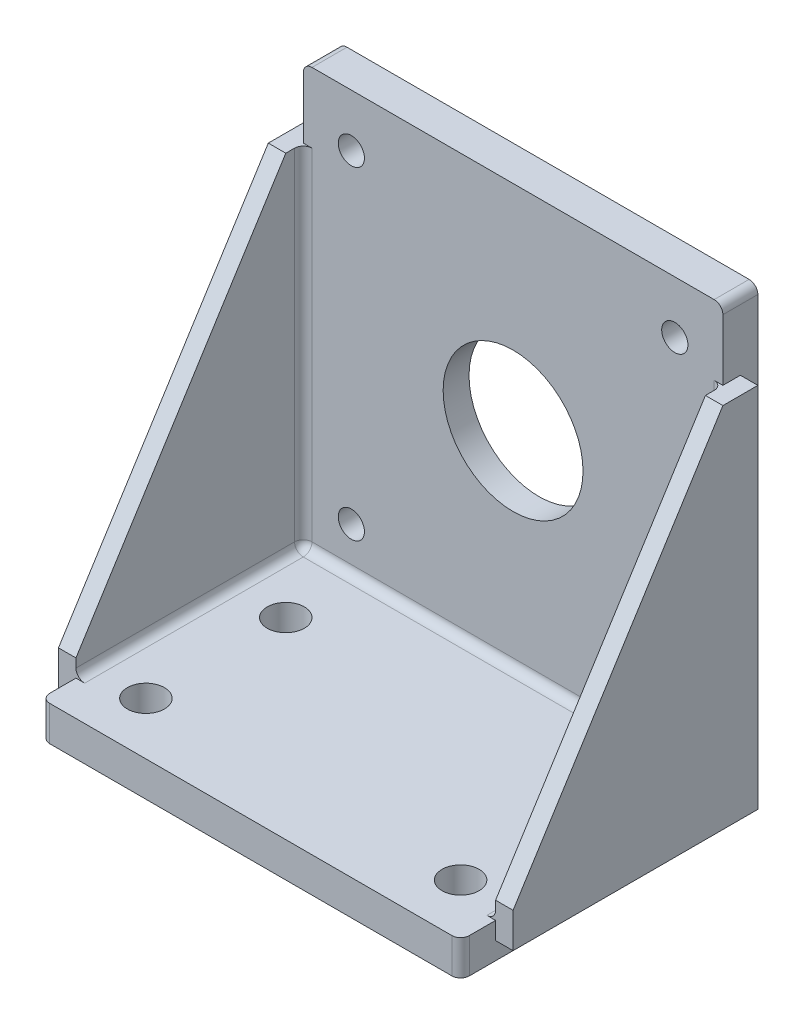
ISO-10303-21;
HEADER;
FILE_DESCRIPTION(('STEP AP214'),'2;1');
FILE_NAME('part.step','',(''),(''),'','','');
FILE_SCHEMA(('AUTOMOTIVE_DESIGN { 1 0 10303 214 1 1 1 1 }'));
ENDSEC;
DATA;
#1=APPLICATION_CONTEXT('core data for automotive mechanical design processes');
#2=APPLICATION_PROTOCOL_DEFINITION('international standard','automotive_design',2000,#1);
#3=PRODUCT_CONTEXT('',#1,'mechanical');
#4=PRODUCT('Part','Part','',(#3));
#5=PRODUCT_RELATED_PRODUCT_CATEGORY('part','',(#4));
#6=PRODUCT_DEFINITION_FORMATION('','',#4);
#7=PRODUCT_DEFINITION_CONTEXT('part definition',#1,'design');
#8=PRODUCT_DEFINITION('design','',#6,#7);
#9=PRODUCT_DEFINITION_SHAPE('','',#8);
#10=(LENGTH_UNIT() NAMED_UNIT(*) SI_UNIT(.MILLI.,.METRE.));
#11=(NAMED_UNIT(*) PLANE_ANGLE_UNIT() SI_UNIT($,.RADIAN.));
#12=(NAMED_UNIT(*) SI_UNIT($,.STERADIAN.) SOLID_ANGLE_UNIT());
#13=UNCERTAINTY_MEASURE_WITH_UNIT(LENGTH_MEASURE(1.E-05),#10,'distance_accuracy_value','');
#14=(GEOMETRIC_REPRESENTATION_CONTEXT(3) GLOBAL_UNCERTAINTY_ASSIGNED_CONTEXT((#13)) GLOBAL_UNIT_ASSIGNED_CONTEXT((#10,
#11,#12)) REPRESENTATION_CONTEXT('',''));
#15=CARTESIAN_POINT('',(0.,0.,0.));
#16=DIRECTION('',(0.,0.,1.));
#17=DIRECTION('',(1.,0.,0.));
#18=AXIS2_PLACEMENT_3D('',#15,#16,#17);
#19=CARTESIAN_POINT('',(-76.2,77.7875,12.7));
#20=DIRECTION('',(1.,0.,0.));
#21=DIRECTION('',(0.,1.,0.));
#22=AXIS2_PLACEMENT_3D('',#19,#20,#21);
#23=PLANE('',#22);
#24=DIRECTION('',(0.,0.,-1.));
#25=VECTOR('',#24,1.);
#26=CARTESIAN_POINT('',(-76.2,-87.3125,107.95));
#27=LINE('',#26,#25);
#28=CARTESIAN_POINT('',(-76.2,-87.3125,104.775));
#29=VERTEX_POINT('',#28);
#30=CARTESIAN_POINT('',(-76.2,-87.3125,6.35));
#31=VERTEX_POINT('',#30);
#32=EDGE_CURVE('E255',#29,#31,#27,.T.);
#33=ORIENTED_EDGE('',*,*,#32,.F.);
#34=DIRECTION('',(0.,1.,0.));
#35=VECTOR('',#34,1.);
#36=CARTESIAN_POINT('',(-76.2,77.7875,104.775));
#37=LINE('',#36,#35);
#38=CARTESIAN_POINT('',(-76.2,-74.6125,104.775));
#39=VERTEX_POINT('',#38);
#40=EDGE_CURVE('E325',#29,#39,#37,.T.);
#41=ORIENTED_EDGE('',*,*,#40,.T.);
#42=DIRECTION('',(0.,0.,1.));
#43=VECTOR('',#42,1.);
#44=CARTESIAN_POINT('',(-76.2,-74.6125,6.35));
#45=LINE('',#44,#43);
#46=CARTESIAN_POINT('',(-76.2,-74.6125,95.25));
#47=VERTEX_POINT('',#46);
#48=EDGE_CURVE('E258',#47,#39,#45,.T.);
#49=ORIENTED_EDGE('',*,*,#48,.F.);
#50=DIRECTION('',(0.,-1.,0.));
#51=VECTOR('',#50,1.);
#52=CARTESIAN_POINT('',(-76.2,-68.2625,95.25));
#53=LINE('',#52,#51);
#54=CARTESIAN_POINT('',(-76.2,-80.9625,95.25));
#55=VERTEX_POINT('',#54);
#56=EDGE_CURVE('E246',#47,#55,#53,.T.);
#57=ORIENTED_EDGE('',*,*,#56,.T.);
#58=DIRECTION('',(0.,0.,1.));
#59=VECTOR('',#58,1.);
#60=CARTESIAN_POINT('',(-76.2,-80.9625,6.35));
#61=LINE('',#60,#59);
#62=CARTESIAN_POINT('',(-76.2,-80.9625,6.35));
#63=VERTEX_POINT('',#62);
#64=EDGE_CURVE('E229',#63,#55,#61,.T.);
#65=ORIENTED_EDGE('',*,*,#64,.F.);
#66=DIRECTION('',(0.,-1.,0.));
#67=VECTOR('',#66,1.);
#68=CARTESIAN_POINT('',(-76.2,-74.6125,6.35));
#69=LINE('',#68,#67);
#70=EDGE_CURVE('E242',#63,#31,#69,.T.);
#71=ORIENTED_EDGE('',*,*,#70,.T.);
#72=EDGE_LOOP('',(#33,#41,#49,#57,#65,#71));
#73=FACE_BOUND('',#72,.T.);
#74=ADVANCED_FACE('F28',(#73),#23,.F.);
#75=CARTESIAN_POINT('',(76.2,-74.6125,12.7));
#76=DIRECTION('',(-1.,0.,0.));
#77=DIRECTION('',(0.,0.,1.));
#78=AXIS2_PLACEMENT_3D('',#75,#76,#77);
#79=PLANE('',#78);
#80=DIRECTION('',(0.,1.,0.));
#81=VECTOR('',#80,1.);
#82=CARTESIAN_POINT('',(76.2,-74.6125,0.));
#83=LINE('',#82,#81);
#84=CARTESIAN_POINT('',(76.2,-74.6125,0.));
#85=VERTEX_POINT('',#84);
#86=CARTESIAN_POINT('',(76.2,74.6125,0.));
#87=VERTEX_POINT('',#86);
#88=EDGE_CURVE('E501',#85,#87,#83,.T.);
#89=ORIENTED_EDGE('',*,*,#88,.T.);
#90=DIRECTION('',(0.,0.,-1.));
#91=VECTOR('',#90,1.);
#92=CARTESIAN_POINT('',(76.2,74.6125,12.7));
#93=LINE('',#92,#91);
#94=CARTESIAN_POINT('',(76.2,74.6125,12.7));
#95=VERTEX_POINT('',#94);
#96=EDGE_CURVE('E312',#87,#95,#93,.F.);
#97=ORIENTED_EDGE('',*,*,#96,.T.);
#98=DIRECTION('',(0.,1.,0.));
#99=VECTOR('',#98,1.);
#100=CARTESIAN_POINT('',(76.2,-74.6125,12.7));
#101=LINE('',#100,#99);
#102=CARTESIAN_POINT('',(76.2,52.3875,12.7));
#103=VERTEX_POINT('',#102);
#104=EDGE_CURVE('E284',#103,#95,#101,.T.);
#105=ORIENTED_EDGE('',*,*,#104,.F.);
#106=DIRECTION('',(0.,0.,1.));
#107=VECTOR('',#106,1.);
#108=CARTESIAN_POINT('',(76.2,52.3875,6.35));
#109=LINE('',#108,#107);
#110=CARTESIAN_POINT('',(76.2,52.3875,6.35));
#111=VERTEX_POINT('',#110);
#112=EDGE_CURVE('E435',#111,#103,#109,.T.);
#113=ORIENTED_EDGE('',*,*,#112,.F.);
#114=DIRECTION('',(0.,1.,0.));
#115=VECTOR('',#114,1.);
#116=CARTESIAN_POINT('',(76.2,-80.9625,6.35));
#117=LINE('',#116,#115);
#118=CARTESIAN_POINT('',(76.2,-74.6125,6.35));
#119=VERTEX_POINT('',#118);
#120=EDGE_CURVE('E450',#119,#111,#117,.T.);
#121=ORIENTED_EDGE('',*,*,#120,.F.);
#122=DIRECTION('',(0.,0.,-1.));
#123=VECTOR('',#122,1.);
#124=CARTESIAN_POINT('',(76.2,-74.6125,12.7));
#125=LINE('',#124,#123);
#126=EDGE_CURVE('E484',#119,#85,#125,.T.);
#127=ORIENTED_EDGE('',*,*,#126,.T.);
#128=EDGE_LOOP('',(#89,#97,#105,#113,#121,#127));
#129=FACE_BOUND('',#128,.T.);
#130=ADVANCED_FACE('F664',(#129),#79,.F.);
#131=CARTESIAN_POINT('',(-76.2,77.7875,12.7));
#132=DIRECTION('',(0.,0.,1.));
#133=DIRECTION('',(1.,0.,0.));
#134=AXIS2_PLACEMENT_3D('',#131,#132,#133);
#135=PLANE('',#134);
#136=CARTESIAN_POINT('',(0.,0.,12.7));
#137=DIRECTION('',(0.,0.,1.));
#138=DIRECTION('',(1.,0.,0.));
#139=AXIS2_PLACEMENT_3D('',#136,#137,#138);
#140=CIRCLE('',#139,25.4);
#141=CARTESIAN_POINT('',(25.4,0.,12.7));
#142=VERTEX_POINT('',#141);
#143=EDGE_CURVE('E617',#142,#142,#140,.T.);
#144=ORIENTED_EDGE('',*,*,#143,.F.);
#145=EDGE_LOOP('',(#144));
#146=FACE_BOUND('',#145,.T.);
#147=CARTESIAN_POINT('',(58.7375,-58.7375,12.7));
#148=DIRECTION('',(0.,0.,1.));
#149=DIRECTION('',(1.,0.,0.));
#150=AXIS2_PLACEMENT_3D('',#147,#148,#149);
#151=CIRCLE('',#150,4.76249999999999);
#152=CARTESIAN_POINT('',(63.5,-58.7375,12.7));
#153=VERTEX_POINT('',#152);
#154=EDGE_CURVE('E523',#153,#153,#151,.T.);
#155=ORIENTED_EDGE('',*,*,#154,.F.);
#156=EDGE_LOOP('',(#155));
#157=FACE_BOUND('',#156,.T.);
#158=CARTESIAN_POINT('',(58.7375,58.7375,12.7));
#159=DIRECTION('',(0.,0.,1.));
#160=DIRECTION('',(1.,0.,0.));
#161=AXIS2_PLACEMENT_3D('',#158,#159,#160);
#162=CIRCLE('',#161,4.7625);
#163=CARTESIAN_POINT('',(63.5,58.7375,12.7));
#164=VERTEX_POINT('',#163);
#165=EDGE_CURVE('E511',#164,#164,#162,.T.);
#166=ORIENTED_EDGE('',*,*,#165,.F.);
#167=EDGE_LOOP('',(#166));
#168=FACE_BOUND('',#167,.T.);
#169=DIRECTION('',(-1.,0.,0.));
#170=VECTOR('',#169,1.);
#171=CARTESIAN_POINT('',(76.2,77.7875,12.7));
#172=LINE('',#171,#170);
#173=CARTESIAN_POINT('',(73.025,77.7875,12.7));
#174=VERTEX_POINT('',#173);
#175=CARTESIAN_POINT('',(-73.0249999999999,77.7875,12.7));
#176=VERTEX_POINT('',#175);
#177=EDGE_CURVE('E285',#174,#176,#172,.T.);
#178=ORIENTED_EDGE('',*,*,#177,.T.);
#179=CARTESIAN_POINT('',(-73.025,74.6125,12.7));
#180=DIRECTION('',(0.,0.,1.));
#181=DIRECTION('',(1.,0.,0.));
#182=AXIS2_PLACEMENT_3D('',#179,#180,#181);
#183=CIRCLE('',#182,3.175);
#184=CARTESIAN_POINT('',(-76.2,74.6125,12.7));
#185=VERTEX_POINT('',#184);
#186=EDGE_CURVE('E310',#176,#185,#183,.T.);
#187=ORIENTED_EDGE('',*,*,#186,.T.);
#188=DIRECTION('',(0.,-1.,0.));
#189=VECTOR('',#188,1.);
#190=CARTESIAN_POINT('',(-76.2,77.7875,12.7));
#191=LINE('',#190,#189);
#192=CARTESIAN_POINT('',(-76.2,52.3875,12.7));
#193=VERTEX_POINT('',#192);
#194=EDGE_CURVE('E281',#185,#193,#191,.T.);
#195=ORIENTED_EDGE('',*,*,#194,.T.);
#196=DIRECTION('',(1.,0.,0.));
#197=VECTOR('',#196,1.);
#198=CARTESIAN_POINT('',(-82.55,52.3875,12.7));
#199=LINE('',#198,#197);
#200=CARTESIAN_POINT('',(-73.025,52.3875,12.7));
#201=VERTEX_POINT('',#200);
#202=EDGE_CURVE('E43',#193,#201,#199,.T.);
#203=ORIENTED_EDGE('',*,*,#202,.T.);
#204=DIRECTION('',(0.,-1.,0.));
#205=VECTOR('',#204,1.);
#206=CARTESIAN_POINT('',(-73.025,77.7875,12.7));
#207=LINE('',#206,#205);
#208=CARTESIAN_POINT('',(-73.025,-71.4375,12.7));
#209=VERTEX_POINT('',#208);
#210=EDGE_CURVE('E306',#201,#209,#207,.T.);
#211=ORIENTED_EDGE('',*,*,#210,.T.);
#212=DIRECTION('',(-1.,0.,0.));
#213=VECTOR('',#212,1.);
#214=CARTESIAN_POINT('',(76.2,-71.4375,12.7));
#215=LINE('',#214,#213);
#216=CARTESIAN_POINT('',(73.025,-71.4375,12.7));
#217=VERTEX_POINT('',#216);
#218=EDGE_CURVE('E387',#209,#217,#215,.F.);
#219=ORIENTED_EDGE('',*,*,#218,.T.);
#220=DIRECTION('',(0.,1.,0.));
#221=VECTOR('',#220,1.);
#222=CARTESIAN_POINT('',(73.025,77.7875,12.7));
#223=LINE('',#222,#221);
#224=CARTESIAN_POINT('',(73.025,52.3875,12.7));
#225=VERTEX_POINT('',#224);
#226=EDGE_CURVE('E302',#217,#225,#223,.T.);
#227=ORIENTED_EDGE('',*,*,#226,.T.);
#228=DIRECTION('',(1.,0.,0.));
#229=VECTOR('',#228,1.);
#230=CARTESIAN_POINT('',(-76.2,52.3875,12.7));
#231=LINE('',#230,#229);
#232=EDGE_CURVE('E300',#225,#103,#231,.T.);
#233=ORIENTED_EDGE('',*,*,#232,.T.);
#234=ORIENTED_EDGE('',*,*,#104,.T.);
#235=CARTESIAN_POINT('',(73.025,74.6125,12.7));
#236=DIRECTION('',(0.,0.,1.));
#237=DIRECTION('',(1.,0.,0.));
#238=AXIS2_PLACEMENT_3D('',#235,#236,#237);
#239=CIRCLE('',#238,3.175);
#240=EDGE_CURVE('E308',#95,#174,#239,.T.);
#241=ORIENTED_EDGE('',*,*,#240,.T.);
#242=EDGE_LOOP('',(#178,#187,#195,#203,#211,#219,#227,#233,#234,#241));
#243=FACE_BOUND('',#242,.T.);
#244=CARTESIAN_POINT('',(-58.7375,58.7375,12.7));
#245=DIRECTION('',(0.,0.,1.));
#246=DIRECTION('',(1.,0.,0.));
#247=AXIS2_PLACEMENT_3D('',#244,#245,#246);
#248=CIRCLE('',#247,4.7625);
#249=CARTESIAN_POINT('',(-53.975,58.7375,12.7));
#250=VERTEX_POINT('',#249);
#251=EDGE_CURVE('E517',#250,#250,#248,.T.);
#252=ORIENTED_EDGE('',*,*,#251,.F.);
#253=EDGE_LOOP('',(#252));
#254=FACE_BOUND('',#253,.T.);
#255=CARTESIAN_POINT('',(-58.7375,-58.7375,12.7));
#256=DIRECTION('',(0.,0.,1.));
#257=DIRECTION('',(1.,0.,0.));
#258=AXIS2_PLACEMENT_3D('',#255,#256,#257);
#259=CIRCLE('',#258,4.7625);
#260=CARTESIAN_POINT('',(-53.975,-58.7375,12.7));
#261=VERTEX_POINT('',#260);
#262=EDGE_CURVE('E529',#261,#261,#259,.T.);
#263=ORIENTED_EDGE('',*,*,#262,.F.);
#264=EDGE_LOOP('',(#263));
#265=FACE_BOUND('',#264,.T.);
#266=ADVANCED_FACE('F341',(#146,#157,#168,#243,#254,#265),#135,.T.);
#267=CARTESIAN_POINT('',(-76.2,77.7875,0.));
#268=DIRECTION('',(0.,0.,1.));
#269=DIRECTION('',(1.,0.,0.));
#270=AXIS2_PLACEMENT_3D('',#267,#268,#269);
#271=PLANE('',#270);
#272=CARTESIAN_POINT('',(0.,0.,0.));
#273=DIRECTION('',(0.,0.,-1.));
#274=DIRECTION('',(-1.,0.,0.));
#275=AXIS2_PLACEMENT_3D('',#272,#273,#274);
#276=CIRCLE('',#275,63.5635);
#277=CARTESIAN_POINT('',(-63.5635,0.,0.));
#278=VERTEX_POINT('',#277);
#279=EDGE_CURVE('E620',#278,#278,#276,.T.);
#280=ORIENTED_EDGE('',*,*,#279,.F.);
#281=EDGE_LOOP('',(#280));
#282=FACE_BOUND('',#281,.T.);
#283=CARTESIAN_POINT('',(58.7375,-58.7375,0.));
#284=DIRECTION('',(0.,0.,1.));
#285=DIRECTION('',(1.,0.,0.));
#286=AXIS2_PLACEMENT_3D('',#283,#284,#285);
#287=CIRCLE('',#286,4.76249999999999);
#288=CARTESIAN_POINT('',(63.5,-58.7375,0.));
#289=VERTEX_POINT('',#288);
#290=EDGE_CURVE('E526',#289,#289,#287,.T.);
#291=ORIENTED_EDGE('',*,*,#290,.T.);
#292=EDGE_LOOP('',(#291));
#293=FACE_BOUND('',#292,.T.);
#294=CARTESIAN_POINT('',(58.7375,58.7375,0.));
#295=DIRECTION('',(0.,0.,1.));
#296=DIRECTION('',(1.,0.,0.));
#297=AXIS2_PLACEMENT_3D('',#294,#295,#296);
#298=CIRCLE('',#297,4.7625);
#299=CARTESIAN_POINT('',(63.5,58.7375,0.));
#300=VERTEX_POINT('',#299);
#301=EDGE_CURVE('E514',#300,#300,#298,.T.);
#302=ORIENTED_EDGE('',*,*,#301,.T.);
#303=EDGE_LOOP('',(#302));
#304=FACE_BOUND('',#303,.T.);
#305=DIRECTION('',(0.,-1.,0.));
#306=VECTOR('',#305,1.);
#307=CARTESIAN_POINT('',(-76.2,77.7875,0.));
#308=LINE('',#307,#306);
#309=CARTESIAN_POINT('',(-76.2,74.6125,0.));
#310=VERTEX_POINT('',#309);
#311=CARTESIAN_POINT('',(-76.2,-74.6125,0.));
#312=VERTEX_POINT('',#311);
#313=EDGE_CURVE('E506',#310,#312,#308,.T.);
#314=ORIENTED_EDGE('',*,*,#313,.F.);
#315=CARTESIAN_POINT('',(-73.025,74.6125,0.));
#316=DIRECTION('',(0.,0.,1.));
#317=DIRECTION('',(1.,0.,0.));
#318=AXIS2_PLACEMENT_3D('',#315,#316,#317);
#319=CIRCLE('',#318,3.175);
#320=CARTESIAN_POINT('',(-73.0249999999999,77.7875,0.));
#321=VERTEX_POINT('',#320);
#322=EDGE_CURVE('E293',#310,#321,#319,.F.);
#323=ORIENTED_EDGE('',*,*,#322,.T.);
#324=DIRECTION('',(-1.,0.,0.));
#325=VECTOR('',#324,1.);
#326=CARTESIAN_POINT('',(76.2,77.7875,0.));
#327=LINE('',#326,#325);
#328=CARTESIAN_POINT('',(73.025,77.7875,0.));
#329=VERTEX_POINT('',#328);
#330=EDGE_CURVE('E508',#329,#321,#327,.T.);
#331=ORIENTED_EDGE('',*,*,#330,.F.);
#332=CARTESIAN_POINT('',(73.025,74.6125,0.));
#333=DIRECTION('',(0.,0.,1.));
#334=DIRECTION('',(1.,0.,0.));
#335=AXIS2_PLACEMENT_3D('',#332,#333,#334);
#336=CIRCLE('',#335,3.175);
#337=EDGE_CURVE('E291',#329,#87,#336,.F.);
#338=ORIENTED_EDGE('',*,*,#337,.T.);
#339=ORIENTED_EDGE('',*,*,#88,.F.);
#340=DIRECTION('',(-1.,0.,0.));
#341=VECTOR('',#340,1.);
#342=CARTESIAN_POINT('',(76.2,-74.6125,0.));
#343=LINE('',#342,#341);
#344=EDGE_CURVE('E503',#85,#312,#343,.T.);
#345=ORIENTED_EDGE('',*,*,#344,.T.);
#346=EDGE_LOOP('',(#314,#323,#331,#338,#339,#345));
#347=FACE_BOUND('',#346,.T.);
#348=CARTESIAN_POINT('',(-58.7375,58.7375,0.));
#349=DIRECTION('',(0.,0.,1.));
#350=DIRECTION('',(1.,0.,0.));
#351=AXIS2_PLACEMENT_3D('',#348,#349,#350);
#352=CIRCLE('',#351,4.7625);
#353=CARTESIAN_POINT('',(-53.975,58.7375,0.));
#354=VERTEX_POINT('',#353);
#355=EDGE_CURVE('E520',#354,#354,#352,.T.);
#356=ORIENTED_EDGE('',*,*,#355,.T.);
#357=EDGE_LOOP('',(#356));
#358=FACE_BOUND('',#357,.T.);
#359=CARTESIAN_POINT('',(-58.7375,-58.7375,0.));
#360=DIRECTION('',(0.,0.,1.));
#361=DIRECTION('',(1.,0.,0.));
#362=AXIS2_PLACEMENT_3D('',#359,#360,#361);
#363=CIRCLE('',#362,4.7625);
#364=CARTESIAN_POINT('',(-53.975,-58.7375,0.));
#365=VERTEX_POINT('',#364);
#366=EDGE_CURVE('E532',#365,#365,#363,.T.);
#367=ORIENTED_EDGE('',*,*,#366,.T.);
#368=EDGE_LOOP('',(#367));
#369=FACE_BOUND('',#368,.T.);
#370=ADVANCED_FACE('F660',(#282,#293,#304,#347,#358,#369),#271,.F.);
#371=CARTESIAN_POINT('',(76.2,77.7875,12.7));
#372=DIRECTION('',(0.,-1.,0.));
#373=DIRECTION('',(1.,0.,0.));
#374=AXIS2_PLACEMENT_3D('',#371,#372,#373);
#375=PLANE('',#374);
#376=ORIENTED_EDGE('',*,*,#330,.T.);
#377=DIRECTION('',(0.,0.,-1.));
#378=VECTOR('',#377,1.);
#379=CARTESIAN_POINT('',(-73.025,77.7875,12.7));
#380=LINE('',#379,#378);
#381=EDGE_CURVE('E298',#321,#176,#380,.F.);
#382=ORIENTED_EDGE('',*,*,#381,.T.);
#383=ORIENTED_EDGE('',*,*,#177,.F.);
#384=DIRECTION('',(0.,0.,-1.));
#385=VECTOR('',#384,1.);
#386=CARTESIAN_POINT('',(73.025,77.7875,12.7));
#387=LINE('',#386,#385);
#388=EDGE_CURVE('E295',#174,#329,#387,.T.);
#389=ORIENTED_EDGE('',*,*,#388,.T.);
#390=EDGE_LOOP('',(#376,#382,#383,#389));
#391=FACE_BOUND('',#390,.T.);
#392=ADVANCED_FACE('F671',(#391),#375,.F.);
#393=ORIENTED_EDGE('',*,*,#194,.F.);
#394=DIRECTION('',(0.,0.,-1.));
#395=VECTOR('',#394,1.);
#396=CARTESIAN_POINT('',(-76.2,74.6125,12.7));
#397=LINE('',#396,#395);
#398=EDGE_CURVE('E288',#185,#310,#397,.T.);
#399=ORIENTED_EDGE('',*,*,#398,.T.);
#400=ORIENTED_EDGE('',*,*,#313,.T.);
#401=DIRECTION('',(0.,0.,-1.));
#402=VECTOR('',#401,1.);
#403=CARTESIAN_POINT('',(-76.2,-74.6125,12.7));
#404=LINE('',#403,#402);
#405=CARTESIAN_POINT('',(-76.2,-74.6125,6.35));
#406=VERTEX_POINT('',#405);
#407=EDGE_CURVE('E487',#406,#312,#404,.T.);
#408=ORIENTED_EDGE('',*,*,#407,.F.);
#409=DIRECTION('',(0.,1.,0.));
#410=VECTOR('',#409,1.);
#411=CARTESIAN_POINT('',(-76.2,-80.9625,6.35));
#412=LINE('',#411,#410);
#413=CARTESIAN_POINT('',(-76.2,52.3875,6.35));
#414=VERTEX_POINT('',#413);
#415=EDGE_CURVE('E454',#406,#414,#412,.T.);
#416=ORIENTED_EDGE('',*,*,#415,.T.);
#417=DIRECTION('',(0.,0.,1.));
#418=VECTOR('',#417,1.);
#419=CARTESIAN_POINT('',(-76.2,52.3875,6.35));
#420=LINE('',#419,#418);
#421=EDGE_CURVE('E248',#414,#193,#420,.T.);
#422=ORIENTED_EDGE('',*,*,#421,.T.);
#423=EDGE_LOOP('',(#393,#399,#400,#408,#416,#422));
#424=FACE_BOUND('',#423,.T.);
#425=ADVANCED_FACE('F654',(#424),#23,.F.);
#426=CARTESIAN_POINT('',(76.2,-74.6125,12.7));
#427=DIRECTION('',(0.,-1.,0.));
#428=DIRECTION('',(1.,0.,0.));
#429=AXIS2_PLACEMENT_3D('',#426,#427,#428);
#430=PLANE('',#429);
#431=DIRECTION('',(1.,0.,0.));
#432=VECTOR('',#431,1.);
#433=CARTESIAN_POINT('',(-76.2,-74.6125,6.35));
#434=LINE('',#433,#432);
#435=EDGE_CURVE('E542',#406,#119,#434,.T.);
#436=ORIENTED_EDGE('',*,*,#435,.F.);
#437=ORIENTED_EDGE('',*,*,#407,.T.);
#438=ORIENTED_EDGE('',*,*,#344,.F.);
#439=ORIENTED_EDGE('',*,*,#126,.F.);
#440=EDGE_LOOP('',(#436,#437,#438,#439));
#441=FACE_BOUND('',#440,.T.);
#442=ADVANCED_FACE('F656',(#441),#430,.T.);
#443=DIRECTION('',(0.,0.,1.));
#444=VECTOR('',#443,1.);
#445=CARTESIAN_POINT('',(76.2,-74.6125,6.35));
#446=LINE('',#445,#444);
#447=CARTESIAN_POINT('',(76.2,-74.6125,95.25));
#448=VERTEX_POINT('',#447);
#449=CARTESIAN_POINT('',(76.2,-74.6125,104.775));
#450=VERTEX_POINT('',#449);
#451=EDGE_CURVE('E256',#448,#450,#446,.T.);
#452=ORIENTED_EDGE('',*,*,#451,.T.);
#453=DIRECTION('',(0.,1.,0.));
#454=VECTOR('',#453,1.);
#455=CARTESIAN_POINT('',(76.2,-74.6125,104.775));
#456=LINE('',#455,#454);
#457=CARTESIAN_POINT('',(76.2,-87.3125,104.775));
#458=VERTEX_POINT('',#457);
#459=EDGE_CURVE('E319',#450,#458,#456,.F.);
#460=ORIENTED_EDGE('',*,*,#459,.T.);
#461=DIRECTION('',(0.,0.,-1.));
#462=VECTOR('',#461,1.);
#463=CARTESIAN_POINT('',(76.2,-87.3125,107.95));
#464=LINE('',#463,#462);
#465=CARTESIAN_POINT('',(76.2,-87.3125,6.35));
#466=VERTEX_POINT('',#465);
#467=EDGE_CURVE('E261',#458,#466,#464,.T.);
#468=ORIENTED_EDGE('',*,*,#467,.T.);
#469=DIRECTION('',(0.,-1.,0.));
#470=VECTOR('',#469,1.);
#471=CARTESIAN_POINT('',(76.2,-74.6125,6.35));
#472=LINE('',#471,#470);
#473=CARTESIAN_POINT('',(76.2,-80.9625,6.35));
#474=VERTEX_POINT('',#473);
#475=EDGE_CURVE('E455',#474,#466,#472,.T.);
#476=ORIENTED_EDGE('',*,*,#475,.F.);
#477=DIRECTION('',(0.,0.,1.));
#478=VECTOR('',#477,1.);
#479=CARTESIAN_POINT('',(76.2,-80.9625,6.35));
#480=LINE('',#479,#478);
#481=CARTESIAN_POINT('',(76.2,-80.9625,95.25));
#482=VERTEX_POINT('',#481);
#483=EDGE_CURVE('E266',#474,#482,#480,.T.);
#484=ORIENTED_EDGE('',*,*,#483,.T.);
#485=DIRECTION('',(0.,-1.,0.));
#486=VECTOR('',#485,1.);
#487=CARTESIAN_POINT('',(76.2,-68.2625,95.25));
#488=LINE('',#487,#486);
#489=EDGE_CURVE('E442',#448,#482,#488,.T.);
#490=ORIENTED_EDGE('',*,*,#489,.F.);
#491=EDGE_LOOP('',(#452,#460,#468,#476,#484,#490));
#492=FACE_BOUND('',#491,.T.);
#493=ADVANCED_FACE('F571',(#492),#79,.F.);
#494=CARTESIAN_POINT('',(58.7375,58.7375,12.7));
#495=DIRECTION('',(0.,0.,-1.));
#496=DIRECTION('',(-1.,0.,0.));
#497=AXIS2_PLACEMENT_3D('',#494,#495,#496);
#498=CYLINDRICAL_SURFACE('',#497,4.7625);
#499=ORIENTED_EDGE('',*,*,#165,.T.);
#500=EDGE_LOOP('',(#499));
#501=FACE_BOUND('',#500,.T.);
#502=ORIENTED_EDGE('',*,*,#301,.F.);
#503=EDGE_LOOP('',(#502));
#504=FACE_BOUND('',#503,.T.);
#505=ADVANCED_FACE('F752',(#501,#504),#498,.F.);
#506=CARTESIAN_POINT('',(-58.7375,58.7375,12.7));
#507=DIRECTION('',(0.,0.,-1.));
#508=DIRECTION('',(-1.,0.,0.));
#509=AXIS2_PLACEMENT_3D('',#506,#507,#508);
#510=CYLINDRICAL_SURFACE('',#509,4.7625);
#511=ORIENTED_EDGE('',*,*,#251,.T.);
#512=EDGE_LOOP('',(#511));
#513=FACE_BOUND('',#512,.T.);
#514=ORIENTED_EDGE('',*,*,#355,.F.);
#515=EDGE_LOOP('',(#514));
#516=FACE_BOUND('',#515,.T.);
#517=ADVANCED_FACE('F748',(#513,#516),#510,.F.);
#518=CARTESIAN_POINT('',(58.7375,-58.7375,12.7));
#519=DIRECTION('',(0.,0.,-1.));
#520=DIRECTION('',(-1.,0.,0.));
#521=AXIS2_PLACEMENT_3D('',#518,#519,#520);
#522=CYLINDRICAL_SURFACE('',#521,4.76249999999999);
#523=ORIENTED_EDGE('',*,*,#154,.T.);
#524=EDGE_LOOP('',(#523));
#525=FACE_BOUND('',#524,.T.);
#526=ORIENTED_EDGE('',*,*,#290,.F.);
#527=EDGE_LOOP('',(#526));
#528=FACE_BOUND('',#527,.T.);
#529=ADVANCED_FACE('F744',(#525,#528),#522,.F.);
#530=CARTESIAN_POINT('',(-58.7375,-58.7375,12.7));
#531=DIRECTION('',(0.,0.,-1.));
#532=DIRECTION('',(-1.,0.,0.));
#533=AXIS2_PLACEMENT_3D('',#530,#531,#532);
#534=CYLINDRICAL_SURFACE('',#533,4.7625);
#535=ORIENTED_EDGE('',*,*,#262,.T.);
#536=EDGE_LOOP('',(#535));
#537=FACE_BOUND('',#536,.T.);
#538=ORIENTED_EDGE('',*,*,#366,.F.);
#539=EDGE_LOOP('',(#538));
#540=FACE_BOUND('',#539,.T.);
#541=ADVANCED_FACE('F741',(#537,#540),#534,.F.);
#542=CARTESIAN_POINT('',(-76.2,-74.6125,6.35));
#543=DIRECTION('',(0.,0.,1.));
#544=DIRECTION('',(0.,-1.,0.));
#545=AXIS2_PLACEMENT_3D('',#542,#543,#544);
#546=PLANE('',#545);
#547=ORIENTED_EDGE('',*,*,#435,.T.);
#548=ORIENTED_EDGE('',*,*,#120,.T.);
#549=DIRECTION('',(-1.,0.,0.));
#550=VECTOR('',#549,1.);
#551=CARTESIAN_POINT('',(82.55,52.3875,6.35));
#552=LINE('',#551,#550);
#553=CARTESIAN_POINT('',(82.55,52.3875,6.35));
#554=VERTEX_POINT('',#553);
#555=EDGE_CURVE('E459',#554,#111,#552,.T.);
#556=ORIENTED_EDGE('',*,*,#555,.F.);
#557=DIRECTION('',(0.,1.,0.));
#558=VECTOR('',#557,1.);
#559=CARTESIAN_POINT('',(82.55,-80.9625,6.35));
#560=LINE('',#559,#558);
#561=CARTESIAN_POINT('',(82.55,-80.9625,6.35));
#562=VERTEX_POINT('',#561);
#563=EDGE_CURVE('E467',#562,#554,#560,.T.);
#564=ORIENTED_EDGE('',*,*,#563,.F.);
#565=DIRECTION('',(-1.,0.,0.));
#566=VECTOR('',#565,1.);
#567=CARTESIAN_POINT('',(82.55,-80.9625,6.35));
#568=LINE('',#567,#566);
#569=EDGE_CURVE('E456',#562,#474,#568,.T.);
#570=ORIENTED_EDGE('',*,*,#569,.T.);
#571=ORIENTED_EDGE('',*,*,#475,.T.);
#572=DIRECTION('',(1.,0.,0.));
#573=VECTOR('',#572,1.);
#574=CARTESIAN_POINT('',(-76.2,-87.3125,6.35));
#575=LINE('',#574,#573);
#576=EDGE_CURVE('E254',#31,#466,#575,.T.);
#577=ORIENTED_EDGE('',*,*,#576,.F.);
#578=ORIENTED_EDGE('',*,*,#70,.F.);
#579=DIRECTION('',(1.,0.,0.));
#580=VECTOR('',#579,1.);
#581=CARTESIAN_POINT('',(-82.55,-80.9625,6.35));
#582=LINE('',#581,#580);
#583=CARTESIAN_POINT('',(-82.55,-80.9625,6.35));
#584=VERTEX_POINT('',#583);
#585=EDGE_CURVE('E225',#584,#63,#582,.T.);
#586=ORIENTED_EDGE('',*,*,#585,.F.);
#587=DIRECTION('',(0.,1.,0.));
#588=VECTOR('',#587,1.);
#589=CARTESIAN_POINT('',(-82.55,-80.9625,6.35));
#590=LINE('',#589,#588);
#591=CARTESIAN_POINT('',(-82.55,52.3875,6.35));
#592=VERTEX_POINT('',#591);
#593=EDGE_CURVE('E418',#584,#592,#590,.T.);
#594=ORIENTED_EDGE('',*,*,#593,.T.);
#595=DIRECTION('',(1.,0.,0.));
#596=VECTOR('',#595,1.);
#597=CARTESIAN_POINT('',(-82.55,52.3875,6.35));
#598=LINE('',#597,#596);
#599=EDGE_CURVE('E236',#592,#414,#598,.T.);
#600=ORIENTED_EDGE('',*,*,#599,.T.);
#601=ORIENTED_EDGE('',*,*,#415,.F.);
#602=EDGE_LOOP('',(#547,#548,#556,#564,#570,#571,#577,#578,#586,#594,#600,#601));
#603=FACE_BOUND('',#602,.T.);
#604=ADVANCED_FACE('F251',(#603),#546,.F.);
#605=CARTESIAN_POINT('',(-76.2,-87.3125,107.95));
#606=DIRECTION('',(0.,-1.,0.));
#607=DIRECTION('',(0.,0.,-1.));
#608=AXIS2_PLACEMENT_3D('',#605,#606,#607);
#609=PLANE('',#608);
#610=CARTESIAN_POINT('',(57.15,-87.3125,88.9));
#611=DIRECTION('',(0.,-1.,0.));
#612=DIRECTION('',(0.,0.,-1.));
#613=AXIS2_PLACEMENT_3D('',#610,#611,#612);
#614=CIRCLE('',#613,6.7437);
#615=CARTESIAN_POINT('',(57.15,-87.3125,95.6437));
#616=VERTEX_POINT('',#615);
#617=EDGE_CURVE('E626',#616,#616,#614,.T.);
#618=ORIENTED_EDGE('',*,*,#617,.F.);
#619=EDGE_LOOP('',(#618));
#620=FACE_BOUND('',#619,.T.);
#621=CARTESIAN_POINT('',(-57.15,-87.3125,88.9));
#622=DIRECTION('',(0.,-1.,0.));
#623=DIRECTION('',(0.,0.,-1.));
#624=AXIS2_PLACEMENT_3D('',#621,#622,#623);
#625=CIRCLE('',#624,6.7437);
#626=CARTESIAN_POINT('',(-57.15,-87.3125,95.6437));
#627=VERTEX_POINT('',#626);
#628=EDGE_CURVE('E635',#627,#627,#625,.T.);
#629=ORIENTED_EDGE('',*,*,#628,.F.);
#630=EDGE_LOOP('',(#629));
#631=FACE_BOUND('',#630,.T.);
#632=ORIENTED_EDGE('',*,*,#467,.F.);
#633=CARTESIAN_POINT('',(73.025,-87.3125,104.775));
#634=DIRECTION('',(0.,-1.,0.));
#635=DIRECTION('',(0.,0.,-1.));
#636=AXIS2_PLACEMENT_3D('',#633,#634,#635);
#637=CIRCLE('',#636,3.175);
#638=CARTESIAN_POINT('',(73.025,-87.3125,107.95));
#639=VERTEX_POINT('',#638);
#640=EDGE_CURVE('E323',#458,#639,#637,.T.);
#641=ORIENTED_EDGE('',*,*,#640,.T.);
#642=DIRECTION('',(1.,0.,0.));
#643=VECTOR('',#642,1.);
#644=CARTESIAN_POINT('',(-76.2,-87.3125,107.95));
#645=LINE('',#644,#643);
#646=CARTESIAN_POINT('',(-73.025,-87.3125,107.95));
#647=VERTEX_POINT('',#646);
#648=EDGE_CURVE('E536',#647,#639,#645,.T.);
#649=ORIENTED_EDGE('',*,*,#648,.F.);
#650=CARTESIAN_POINT('',(-73.025,-87.3125,104.775));
#651=DIRECTION('',(0.,-1.,0.));
#652=DIRECTION('',(0.,0.,-1.));
#653=AXIS2_PLACEMENT_3D('',#650,#651,#652);
#654=CIRCLE('',#653,3.175);
#655=EDGE_CURVE('E321',#647,#29,#654,.T.);
#656=ORIENTED_EDGE('',*,*,#655,.T.);
#657=ORIENTED_EDGE('',*,*,#32,.T.);
#658=ORIENTED_EDGE('',*,*,#576,.T.);
#659=EDGE_LOOP('',(#632,#641,#649,#656,#657,#658));
#660=FACE_BOUND('',#659,.T.);
#661=CARTESIAN_POINT('',(-57.1499999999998,-87.3125,38.1));
#662=DIRECTION('',(0.,-1.,0.));
#663=DIRECTION('',(0.,0.,-1.));
#664=AXIS2_PLACEMENT_3D('',#661,#662,#663);
#665=CIRCLE('',#664,6.7437);
#666=CARTESIAN_POINT('',(-57.1499999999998,-87.3125,44.8437));
#667=VERTEX_POINT('',#666);
#668=EDGE_CURVE('E400',#667,#667,#665,.T.);
#669=ORIENTED_EDGE('',*,*,#668,.F.);
#670=EDGE_LOOP('',(#669));
#671=FACE_BOUND('',#670,.T.);
#672=CARTESIAN_POINT('',(57.1500000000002,-87.3125,38.1));
#673=DIRECTION('',(0.,-1.,0.));
#674=DIRECTION('',(0.,0.,-1.));
#675=AXIS2_PLACEMENT_3D('',#672,#673,#674);
#676=CIRCLE('',#675,6.7437);
#677=CARTESIAN_POINT('',(57.1500000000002,-87.3125,44.8437));
#678=VERTEX_POINT('',#677);
#679=EDGE_CURVE('E394',#678,#678,#676,.T.);
#680=ORIENTED_EDGE('',*,*,#679,.F.);
#681=EDGE_LOOP('',(#680));
#682=FACE_BOUND('',#681,.T.);
#683=ADVANCED_FACE('F563',(#620,#631,#660,#671,#682),#609,.T.);
#684=CARTESIAN_POINT('',(-76.2,-87.3125,107.95));
#685=DIRECTION('',(0.,0.,-1.));
#686=DIRECTION('',(-1.,0.,0.));
#687=AXIS2_PLACEMENT_3D('',#684,#685,#686);
#688=PLANE('',#687);
#689=ORIENTED_EDGE('',*,*,#648,.T.);
#690=DIRECTION('',(0.,1.,0.));
#691=VECTOR('',#690,1.);
#692=CARTESIAN_POINT('',(73.025,-87.3125,107.95));
#693=LINE('',#692,#691);
#694=CARTESIAN_POINT('',(73.025,-74.6125,107.95));
#695=VERTEX_POINT('',#694);
#696=EDGE_CURVE('E316',#639,#695,#693,.T.);
#697=ORIENTED_EDGE('',*,*,#696,.T.);
#698=DIRECTION('',(1.,0.,0.));
#699=VECTOR('',#698,1.);
#700=CARTESIAN_POINT('',(-76.2,-74.6125,107.95));
#701=LINE('',#700,#699);
#702=CARTESIAN_POINT('',(-73.025,-74.6125,107.95));
#703=VERTEX_POINT('',#702);
#704=EDGE_CURVE('E539',#703,#695,#701,.T.);
#705=ORIENTED_EDGE('',*,*,#704,.F.);
#706=DIRECTION('',(0.,1.,0.));
#707=VECTOR('',#706,1.);
#708=CARTESIAN_POINT('',(-73.025,-87.3125,107.95));
#709=LINE('',#708,#707);
#710=EDGE_CURVE('E314',#703,#647,#709,.F.);
#711=ORIENTED_EDGE('',*,*,#710,.T.);
#712=EDGE_LOOP('',(#689,#697,#705,#711));
#713=FACE_BOUND('',#712,.T.);
#714=ADVANCED_FACE('F559',(#713),#688,.F.);
#715=CARTESIAN_POINT('',(-76.2,-74.6125,6.35));
#716=DIRECTION('',(0.,1.,0.));
#717=DIRECTION('',(0.,0.,1.));
#718=AXIS2_PLACEMENT_3D('',#715,#716,#717);
#719=PLANE('',#718);
#720=CARTESIAN_POINT('',(57.15,-74.6125,88.9));
#721=DIRECTION('',(0.,1.,0.));
#722=DIRECTION('',(0.,0.,1.));
#723=AXIS2_PLACEMENT_3D('',#720,#721,#722);
#724=CIRCLE('',#723,6.7437);
#725=CARTESIAN_POINT('',(57.15,-74.6125,95.6437));
#726=VERTEX_POINT('',#725);
#727=EDGE_CURVE('E629',#726,#726,#724,.T.);
#728=ORIENTED_EDGE('',*,*,#727,.F.);
#729=EDGE_LOOP('',(#728));
#730=FACE_BOUND('',#729,.T.);
#731=CARTESIAN_POINT('',(-57.15,-74.6125,88.9));
#732=DIRECTION('',(0.,1.,0.));
#733=DIRECTION('',(0.,0.,1.));
#734=AXIS2_PLACEMENT_3D('',#731,#732,#733);
#735=CIRCLE('',#734,6.7437);
#736=CARTESIAN_POINT('',(-57.15,-74.6125,95.6437));
#737=VERTEX_POINT('',#736);
#738=EDGE_CURVE('E632',#737,#737,#735,.T.);
#739=ORIENTED_EDGE('',*,*,#738,.F.);
#740=EDGE_LOOP('',(#739));
#741=FACE_BOUND('',#740,.T.);
#742=DIRECTION('',(-1.,0.,0.));
#743=VECTOR('',#742,1.);
#744=CARTESIAN_POINT('',(-76.2,-74.6125,15.875));
#745=LINE('',#744,#743);
#746=CARTESIAN_POINT('',(73.025,-74.6125,15.875));
#747=VERTEX_POINT('',#746);
#748=CARTESIAN_POINT('',(-73.025,-74.6125,15.875));
#749=VERTEX_POINT('',#748);
#750=EDGE_CURVE('E389',#747,#749,#745,.T.);
#751=ORIENTED_EDGE('',*,*,#750,.T.);
#752=DIRECTION('',(0.,0.,1.));
#753=VECTOR('',#752,1.);
#754=CARTESIAN_POINT('',(-73.025,-74.6125,6.35));
#755=LINE('',#754,#753);
#756=CARTESIAN_POINT('',(-73.025,-74.6125,95.25));
#757=VERTEX_POINT('',#756);
#758=EDGE_CURVE('E375',#749,#757,#755,.T.);
#759=ORIENTED_EDGE('',*,*,#758,.T.);
#760=DIRECTION('',(-1.,0.,0.));
#761=VECTOR('',#760,1.);
#762=CARTESIAN_POINT('',(-82.55,-74.6125,95.25));
#763=LINE('',#762,#761);
#764=EDGE_CURVE('E378',#757,#47,#763,.T.);
#765=ORIENTED_EDGE('',*,*,#764,.T.);
#766=ORIENTED_EDGE('',*,*,#48,.T.);
#767=CARTESIAN_POINT('',(-73.025,-74.6125,104.775));
#768=DIRECTION('',(0.,1.,0.));
#769=DIRECTION('',(0.,0.,1.));
#770=AXIS2_PLACEMENT_3D('',#767,#768,#769);
#771=CIRCLE('',#770,3.175);
#772=EDGE_CURVE('E385',#39,#703,#771,.T.);
#773=ORIENTED_EDGE('',*,*,#772,.T.);
#774=ORIENTED_EDGE('',*,*,#704,.T.);
#775=CARTESIAN_POINT('',(73.025,-74.6125,104.775));
#776=DIRECTION('',(0.,1.,0.));
#777=DIRECTION('',(0.,0.,1.));
#778=AXIS2_PLACEMENT_3D('',#775,#776,#777);
#779=CIRCLE('',#778,3.175);
#780=EDGE_CURVE('E383',#695,#450,#779,.T.);
#781=ORIENTED_EDGE('',*,*,#780,.T.);
#782=ORIENTED_EDGE('',*,*,#451,.F.);
#783=DIRECTION('',(-1.,0.,0.));
#784=VECTOR('',#783,1.);
#785=CARTESIAN_POINT('',(-76.2,-74.6125,95.25));
#786=LINE('',#785,#784);
#787=CARTESIAN_POINT('',(73.025,-74.6125,95.25));
#788=VERTEX_POINT('',#787);
#789=EDGE_CURVE('E51',#448,#788,#786,.T.);
#790=ORIENTED_EDGE('',*,*,#789,.T.);
#791=DIRECTION('',(0.,0.,1.));
#792=VECTOR('',#791,1.);
#793=CARTESIAN_POINT('',(73.025,-74.6125,6.35));
#794=LINE('',#793,#792);
#795=EDGE_CURVE('E381',#788,#747,#794,.F.);
#796=ORIENTED_EDGE('',*,*,#795,.T.);
#797=EDGE_LOOP('',(#751,#759,#765,#766,#773,#774,#781,#782,#790,#796));
#798=FACE_BOUND('',#797,.T.);
#799=CARTESIAN_POINT('',(-57.1499999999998,-74.6125,38.1));
#800=DIRECTION('',(0.,1.,0.));
#801=DIRECTION('',(0.,0.,1.));
#802=AXIS2_PLACEMENT_3D('',#799,#800,#801);
#803=CIRCLE('',#802,6.7437);
#804=CARTESIAN_POINT('',(-57.1499999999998,-74.6125,44.8437));
#805=VERTEX_POINT('',#804);
#806=EDGE_CURVE('E397',#805,#805,#803,.T.);
#807=ORIENTED_EDGE('',*,*,#806,.F.);
#808=EDGE_LOOP('',(#807));
#809=FACE_BOUND('',#808,.T.);
#810=CARTESIAN_POINT('',(57.1500000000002,-74.6125,38.1));
#811=DIRECTION('',(0.,1.,0.));
#812=DIRECTION('',(0.,0.,1.));
#813=AXIS2_PLACEMENT_3D('',#810,#811,#812);
#814=CIRCLE('',#813,6.7437);
#815=CARTESIAN_POINT('',(57.1500000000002,-74.6125,44.8437));
#816=VERTEX_POINT('',#815);
#817=EDGE_CURVE('E391',#816,#816,#814,.T.);
#818=ORIENTED_EDGE('',*,*,#817,.F.);
#819=EDGE_LOOP('',(#818));
#820=FACE_BOUND('',#819,.T.);
#821=ADVANCED_FACE('F548',(#730,#741,#798,#809,#820),#719,.T.);
#822=CARTESIAN_POINT('',(82.55,52.3875,6.35));
#823=DIRECTION('',(0.,-1.,0.));
#824=DIRECTION('',(0.,0.,-1.));
#825=AXIS2_PLACEMENT_3D('',#822,#823,#824);
#826=PLANE('',#825);
#827=ORIENTED_EDGE('',*,*,#112,.T.);
#828=ORIENTED_EDGE('',*,*,#232,.F.);
#829=CARTESIAN_POINT('',(73.025,52.3875,15.875));
#830=DIRECTION('',(0.,-1.,0.));
#831=DIRECTION('',(0.,0.,-1.));
#832=AXIS2_PLACEMENT_3D('',#829,#830,#831);
#833=CIRCLE('',#832,3.175);
#834=CARTESIAN_POINT('',(76.2,52.3875,15.875));
#835=VERTEX_POINT('',#834);
#836=EDGE_CURVE('E11',#225,#835,#833,.T.);
#837=ORIENTED_EDGE('',*,*,#836,.T.);
#838=CARTESIAN_POINT('',(76.2,52.3875,19.05));
#839=VERTEX_POINT('',#838);
#840=EDGE_CURVE('E434',#835,#839,#109,.T.);
#841=ORIENTED_EDGE('',*,*,#840,.T.);
#842=DIRECTION('',(-1.,0.,0.));
#843=VECTOR('',#842,1.);
#844=CARTESIAN_POINT('',(82.55,52.3875,19.05));
#845=LINE('',#844,#843);
#846=CARTESIAN_POINT('',(82.55,52.3875,19.05));
#847=VERTEX_POINT('',#846);
#848=EDGE_CURVE('E478',#847,#839,#845,.T.);
#849=ORIENTED_EDGE('',*,*,#848,.F.);
#850=DIRECTION('',(0.,0.,1.));
#851=VECTOR('',#850,1.);
#852=CARTESIAN_POINT('',(82.55,52.3875,6.35));
#853=LINE('',#852,#851);
#854=EDGE_CURVE('E447',#554,#847,#853,.T.);
#855=ORIENTED_EDGE('',*,*,#854,.F.);
#856=ORIENTED_EDGE('',*,*,#555,.T.);
#857=EDGE_LOOP('',(#827,#828,#837,#841,#849,#855,#856));
#858=FACE_BOUND('',#857,.T.);
#859=ADVANCED_FACE('F587',(#858),#826,.F.);
#860=CARTESIAN_POINT('',(82.55,52.3875,19.05));
#861=DIRECTION('',(0.,-0.533992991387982,-0.845488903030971));
#862=DIRECTION('',(0.,0.845488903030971,-0.533992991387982));
#863=AXIS2_PLACEMENT_3D('',#860,#861,#862);
#864=PLANE('',#863);
#865=DIRECTION('',(0.,-0.845488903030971,0.533992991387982));
#866=VECTOR('',#865,1.);
#867=CARTESIAN_POINT('',(76.2,52.3875,19.05));
#868=LINE('',#867,#866);
#869=CARTESIAN_POINT('',(76.2,-68.2625,95.25));
#870=VERTEX_POINT('',#869);
#871=EDGE_CURVE('E438',#839,#870,#868,.T.);
#872=ORIENTED_EDGE('',*,*,#871,.T.);
#873=DIRECTION('',(-1.,0.,0.));
#874=VECTOR('',#873,1.);
#875=CARTESIAN_POINT('',(82.55,-68.2625,95.25));
#876=LINE('',#875,#874);
#877=CARTESIAN_POINT('',(82.55,-68.2625,95.25));
#878=VERTEX_POINT('',#877);
#879=EDGE_CURVE('E464',#878,#870,#876,.T.);
#880=ORIENTED_EDGE('',*,*,#879,.F.);
#881=DIRECTION('',(0.,-0.845488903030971,0.533992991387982));
#882=VECTOR('',#881,1.);
#883=CARTESIAN_POINT('',(82.55,52.3875,19.05));
#884=LINE('',#883,#882);
#885=EDGE_CURVE('E581',#847,#878,#884,.T.);
#886=ORIENTED_EDGE('',*,*,#885,.F.);
#887=ORIENTED_EDGE('',*,*,#848,.T.);
#888=EDGE_LOOP('',(#872,#880,#886,#887));
#889=FACE_BOUND('',#888,.T.);
#890=ADVANCED_FACE('F591',(#889),#864,.F.);
#891=CARTESIAN_POINT('',(82.55,-68.2625,95.25));
#892=DIRECTION('',(0.,0.,-1.));
#893=DIRECTION('',(-1.,0.,0.));
#894=AXIS2_PLACEMENT_3D('',#891,#892,#893);
#895=PLANE('',#894);
#896=CARTESIAN_POINT('',(76.2,-71.4375,95.25));
#897=VERTEX_POINT('',#896);
#898=EDGE_CURVE('E440',#870,#897,#488,.T.);
#899=ORIENTED_EDGE('',*,*,#898,.T.);
#900=CARTESIAN_POINT('',(73.025,-71.4375,95.25));
#901=DIRECTION('',(0.,0.,-1.));
#902=DIRECTION('',(-1.,0.,0.));
#903=AXIS2_PLACEMENT_3D('',#900,#901,#902);
#904=CIRCLE('',#903,3.175);
#905=EDGE_CURVE('E330',#897,#788,#904,.T.);
#906=ORIENTED_EDGE('',*,*,#905,.T.);
#907=ORIENTED_EDGE('',*,*,#789,.F.);
#908=ORIENTED_EDGE('',*,*,#489,.T.);
#909=DIRECTION('',(-1.,0.,0.));
#910=VECTOR('',#909,1.);
#911=CARTESIAN_POINT('',(82.55,-80.9625,95.25));
#912=LINE('',#911,#910);
#913=CARTESIAN_POINT('',(82.55,-80.9625,95.25));
#914=VERTEX_POINT('',#913);
#915=EDGE_CURVE('E458',#914,#482,#912,.T.);
#916=ORIENTED_EDGE('',*,*,#915,.F.);
#917=DIRECTION('',(0.,-1.,0.));
#918=VECTOR('',#917,1.);
#919=CARTESIAN_POINT('',(82.55,-68.2625,95.25));
#920=LINE('',#919,#918);
#921=EDGE_CURVE('E580',#878,#914,#920,.T.);
#922=ORIENTED_EDGE('',*,*,#921,.F.);
#923=ORIENTED_EDGE('',*,*,#879,.T.);
#924=EDGE_LOOP('',(#899,#906,#907,#908,#916,#922,#923));
#925=FACE_BOUND('',#924,.T.);
#926=ADVANCED_FACE('F573',(#925),#895,.F.);
#927=CARTESIAN_POINT('',(82.55,-80.9625,6.35));
#928=DIRECTION('',(0.,-1.,0.));
#929=DIRECTION('',(0.,0.,-1.));
#930=AXIS2_PLACEMENT_3D('',#927,#928,#929);
#931=PLANE('',#930);
#932=ORIENTED_EDGE('',*,*,#483,.F.);
#933=ORIENTED_EDGE('',*,*,#569,.F.);
#934=DIRECTION('',(0.,0.,1.));
#935=VECTOR('',#934,1.);
#936=CARTESIAN_POINT('',(82.55,-80.9625,6.35));
#937=LINE('',#936,#935);
#938=EDGE_CURVE('E472',#562,#914,#937,.T.);
#939=ORIENTED_EDGE('',*,*,#938,.T.);
#940=ORIENTED_EDGE('',*,*,#915,.T.);
#941=EDGE_LOOP('',(#932,#933,#939,#940));
#942=FACE_BOUND('',#941,.T.);
#943=ADVANCED_FACE('F577',(#942),#931,.T.);
#944=CARTESIAN_POINT('',(82.55,52.3875,95.25));
#945=DIRECTION('',(1.,0.,0.));
#946=DIRECTION('',(0.,0.,-1.));
#947=AXIS2_PLACEMENT_3D('',#944,#945,#946);
#948=PLANE('',#947);
#949=ORIENTED_EDGE('',*,*,#854,.T.);
#950=ORIENTED_EDGE('',*,*,#885,.T.);
#951=ORIENTED_EDGE('',*,*,#921,.T.);
#952=ORIENTED_EDGE('',*,*,#938,.F.);
#953=ORIENTED_EDGE('',*,*,#563,.T.);
#954=EDGE_LOOP('',(#949,#950,#951,#952,#953));
#955=FACE_BOUND('',#954,.T.);
#956=ADVANCED_FACE('F586',(#955),#948,.T.);
#957=CARTESIAN_POINT('',(76.2,52.3875,95.25));
#958=DIRECTION('',(1.,0.,0.));
#959=DIRECTION('',(0.,0.,-1.));
#960=AXIS2_PLACEMENT_3D('',#957,#958,#959);
#961=PLANE('',#960);
#962=DIRECTION('',(0.,1.,0.));
#963=VECTOR('',#962,1.);
#964=CARTESIAN_POINT('',(76.2,52.3875,15.875));
#965=LINE('',#964,#963);
#966=CARTESIAN_POINT('',(76.2,-71.4375,15.875));
#967=VERTEX_POINT('',#966);
#968=EDGE_CURVE('E368',#835,#967,#965,.F.);
#969=ORIENTED_EDGE('',*,*,#968,.T.);
#970=DIRECTION('',(0.,0.,1.));
#971=VECTOR('',#970,1.);
#972=CARTESIAN_POINT('',(76.2,-71.4375,95.25));
#973=LINE('',#972,#971);
#974=EDGE_CURVE('E365',#967,#897,#973,.T.);
#975=ORIENTED_EDGE('',*,*,#974,.T.);
#976=ORIENTED_EDGE('',*,*,#898,.F.);
#977=ORIENTED_EDGE('',*,*,#871,.F.);
#978=ORIENTED_EDGE('',*,*,#840,.F.);
#979=EDGE_LOOP('',(#969,#975,#976,#977,#978));
#980=FACE_BOUND('',#979,.T.);
#981=ADVANCED_FACE('F594',(#980),#961,.F.);
#982=CARTESIAN_POINT('',(-82.55,52.3875,6.35));
#983=DIRECTION('',(0.,1.,0.));
#984=DIRECTION('',(0.,0.,1.));
#985=AXIS2_PLACEMENT_3D('',#982,#983,#984);
#986=PLANE('',#985);
#987=ORIENTED_EDGE('',*,*,#421,.F.);
#988=ORIENTED_EDGE('',*,*,#599,.F.);
#989=DIRECTION('',(0.,0.,1.));
#990=VECTOR('',#989,1.);
#991=CARTESIAN_POINT('',(-82.55,52.3875,6.35));
#992=LINE('',#991,#990);
#993=CARTESIAN_POINT('',(-82.55,52.3875,19.05));
#994=VERTEX_POINT('',#993);
#995=EDGE_CURVE('E415',#592,#994,#992,.T.);
#996=ORIENTED_EDGE('',*,*,#995,.T.);
#997=DIRECTION('',(1.,0.,0.));
#998=VECTOR('',#997,1.);
#999=CARTESIAN_POINT('',(-82.55,52.3875,19.05));
#1000=LINE('',#999,#998);
#1001=CARTESIAN_POINT('',(-76.2,52.3875,19.05));
#1002=VERTEX_POINT('',#1001);
#1003=EDGE_CURVE('E427',#994,#1002,#1000,.T.);
#1004=ORIENTED_EDGE('',*,*,#1003,.T.);
#1005=CARTESIAN_POINT('',(-76.2,52.3875,15.875));
#1006=VERTEX_POINT('',#1005);
#1007=EDGE_CURVE('E335',#1006,#1002,#420,.T.);
#1008=ORIENTED_EDGE('',*,*,#1007,.F.);
#1009=CARTESIAN_POINT('',(-73.025,52.3875,15.875));
#1010=DIRECTION('',(0.,1.,0.));
#1011=DIRECTION('',(0.,0.,1.));
#1012=AXIS2_PLACEMENT_3D('',#1009,#1010,#1011);
#1013=CIRCLE('',#1012,3.175);
#1014=EDGE_CURVE('E36',#1006,#201,#1013,.F.);
#1015=ORIENTED_EDGE('',*,*,#1014,.T.);
#1016=ORIENTED_EDGE('',*,*,#202,.F.);
#1017=EDGE_LOOP('',(#987,#988,#996,#1004,#1008,#1015,#1016));
#1018=FACE_BOUND('',#1017,.T.);
#1019=ADVANCED_FACE('F333',(#1018),#986,.T.);
#1020=CARTESIAN_POINT('',(-82.55,-80.9625,6.35));
#1021=DIRECTION('',(0.,1.,0.));
#1022=DIRECTION('',(0.,0.,1.));
#1023=AXIS2_PLACEMENT_3D('',#1020,#1021,#1022);
#1024=PLANE('',#1023);
#1025=ORIENTED_EDGE('',*,*,#64,.T.);
#1026=DIRECTION('',(1.,0.,0.));
#1027=VECTOR('',#1026,1.);
#1028=CARTESIAN_POINT('',(-82.55,-80.9625,95.25));
#1029=LINE('',#1028,#1027);
#1030=CARTESIAN_POINT('',(-82.55,-80.9625,95.25));
#1031=VERTEX_POINT('',#1030);
#1032=EDGE_CURVE('E237',#1031,#55,#1029,.T.);
#1033=ORIENTED_EDGE('',*,*,#1032,.F.);
#1034=DIRECTION('',(0.,0.,1.));
#1035=VECTOR('',#1034,1.);
#1036=CARTESIAN_POINT('',(-82.55,-80.9625,6.35));
#1037=LINE('',#1036,#1035);
#1038=EDGE_CURVE('E231',#584,#1031,#1037,.T.);
#1039=ORIENTED_EDGE('',*,*,#1038,.F.);
#1040=ORIENTED_EDGE('',*,*,#585,.T.);
#1041=EDGE_LOOP('',(#1025,#1033,#1039,#1040));
#1042=FACE_BOUND('',#1041,.T.);
#1043=ADVANCED_FACE('F227',(#1042),#1024,.F.);
#1044=CARTESIAN_POINT('',(-82.55,-68.2625,95.25));
#1045=DIRECTION('',(0.,0.,1.));
#1046=DIRECTION('',(1.,0.,0.));
#1047=AXIS2_PLACEMENT_3D('',#1044,#1045,#1046);
#1048=PLANE('',#1047);
#1049=CARTESIAN_POINT('',(-76.2,-68.2625,95.25));
#1050=VERTEX_POINT('',#1049);
#1051=CARTESIAN_POINT('',(-76.2,-71.4375,95.25));
#1052=VERTEX_POINT('',#1051);
#1053=EDGE_CURVE('E247',#1050,#1052,#53,.T.);
#1054=ORIENTED_EDGE('',*,*,#1053,.F.);
#1055=DIRECTION('',(1.,0.,0.));
#1056=VECTOR('',#1055,1.);
#1057=CARTESIAN_POINT('',(-82.55,-68.2625,95.25));
#1058=LINE('',#1057,#1056);
#1059=CARTESIAN_POINT('',(-82.55,-68.2625,95.25));
#1060=VERTEX_POINT('',#1059);
#1061=EDGE_CURVE('E429',#1060,#1050,#1058,.T.);
#1062=ORIENTED_EDGE('',*,*,#1061,.F.);
#1063=DIRECTION('',(0.,-1.,0.));
#1064=VECTOR('',#1063,1.);
#1065=CARTESIAN_POINT('',(-82.55,-68.2625,95.25));
#1066=LINE('',#1065,#1064);
#1067=EDGE_CURVE('E421',#1060,#1031,#1066,.T.);
#1068=ORIENTED_EDGE('',*,*,#1067,.T.);
#1069=ORIENTED_EDGE('',*,*,#1032,.T.);
#1070=ORIENTED_EDGE('',*,*,#56,.F.);
#1071=ORIENTED_EDGE('',*,*,#764,.F.);
#1072=CARTESIAN_POINT('',(-73.025,-71.4375,95.25));
#1073=DIRECTION('',(0.,0.,1.));
#1074=DIRECTION('',(1.,0.,0.));
#1075=AXIS2_PLACEMENT_3D('',#1072,#1073,#1074);
#1076=CIRCLE('',#1075,3.175);
#1077=EDGE_CURVE('E328',#757,#1052,#1076,.F.);
#1078=ORIENTED_EDGE('',*,*,#1077,.T.);
#1079=EDGE_LOOP('',(#1054,#1062,#1068,#1069,#1070,#1071,#1078));
#1080=FACE_BOUND('',#1079,.T.);
#1081=ADVANCED_FACE('F649',(#1080),#1048,.T.);
#1082=CARTESIAN_POINT('',(-82.55,52.3875,19.05));
#1083=DIRECTION('',(0.,0.533992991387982,0.845488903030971));
#1084=DIRECTION('',(0.,-0.845488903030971,0.533992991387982));
#1085=AXIS2_PLACEMENT_3D('',#1082,#1083,#1084);
#1086=PLANE('',#1085);
#1087=DIRECTION('',(0.,-0.845488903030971,0.533992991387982));
#1088=VECTOR('',#1087,1.);
#1089=CARTESIAN_POINT('',(-76.2,52.3875,19.05));
#1090=LINE('',#1089,#1088);
#1091=EDGE_CURVE('E412',#1002,#1050,#1090,.T.);
#1092=ORIENTED_EDGE('',*,*,#1091,.F.);
#1093=ORIENTED_EDGE('',*,*,#1003,.F.);
#1094=DIRECTION('',(0.,-0.845488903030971,0.533992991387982));
#1095=VECTOR('',#1094,1.);
#1096=CARTESIAN_POINT('',(-82.55,52.3875,19.05));
#1097=LINE('',#1096,#1095);
#1098=EDGE_CURVE('E424',#994,#1060,#1097,.T.);
#1099=ORIENTED_EDGE('',*,*,#1098,.T.);
#1100=ORIENTED_EDGE('',*,*,#1061,.T.);
#1101=EDGE_LOOP('',(#1092,#1093,#1099,#1100));
#1102=FACE_BOUND('',#1101,.T.);
#1103=ADVANCED_FACE('F645',(#1102),#1086,.T.);
#1104=CARTESIAN_POINT('',(-82.55,52.3875,95.25));
#1105=DIRECTION('',(-1.,0.,0.));
#1106=DIRECTION('',(0.,0.,-1.));
#1107=AXIS2_PLACEMENT_3D('',#1104,#1105,#1106);
#1108=PLANE('',#1107);
#1109=ORIENTED_EDGE('',*,*,#995,.F.);
#1110=ORIENTED_EDGE('',*,*,#593,.F.);
#1111=ORIENTED_EDGE('',*,*,#1038,.T.);
#1112=ORIENTED_EDGE('',*,*,#1067,.F.);
#1113=ORIENTED_EDGE('',*,*,#1098,.F.);
#1114=EDGE_LOOP('',(#1109,#1110,#1111,#1112,#1113));
#1115=FACE_BOUND('',#1114,.T.);
#1116=ADVANCED_FACE('F853',(#1115),#1108,.T.);
#1117=CARTESIAN_POINT('',(-76.2,52.3875,95.25));
#1118=DIRECTION('',(-1.,0.,0.));
#1119=DIRECTION('',(0.,0.,-1.));
#1120=AXIS2_PLACEMENT_3D('',#1117,#1118,#1119);
#1121=PLANE('',#1120);
#1122=ORIENTED_EDGE('',*,*,#1053,.T.);
#1123=DIRECTION('',(0.,0.,1.));
#1124=VECTOR('',#1123,1.);
#1125=CARTESIAN_POINT('',(-76.2,-71.4375,95.25));
#1126=LINE('',#1125,#1124);
#1127=CARTESIAN_POINT('',(-76.2,-71.4375,15.875));
#1128=VERTEX_POINT('',#1127);
#1129=EDGE_CURVE('E372',#1052,#1128,#1126,.F.);
#1130=ORIENTED_EDGE('',*,*,#1129,.T.);
#1131=DIRECTION('',(0.,-1.,0.));
#1132=VECTOR('',#1131,1.);
#1133=CARTESIAN_POINT('',(-76.2,52.3875,15.875));
#1134=LINE('',#1133,#1132);
#1135=EDGE_CURVE('E352',#1128,#1006,#1134,.F.);
#1136=ORIENTED_EDGE('',*,*,#1135,.T.);
#1137=ORIENTED_EDGE('',*,*,#1007,.T.);
#1138=ORIENTED_EDGE('',*,*,#1091,.T.);
#1139=EDGE_LOOP('',(#1122,#1130,#1136,#1137,#1138));
#1140=FACE_BOUND('',#1139,.T.);
#1141=ADVANCED_FACE('F640',(#1140),#1121,.F.);
#1142=CARTESIAN_POINT('',(-57.15,-87.312525,88.9));
#1143=DIRECTION('',(0.,1.,0.));
#1144=DIRECTION('',(0.,0.,1.));
#1145=AXIS2_PLACEMENT_3D('',#1142,#1143,#1144);
#1146=CYLINDRICAL_SURFACE('',#1145,6.7437);
#1147=CARTESIAN_POINT('',(-57.15,-87.3125,95.6437));
#1148=CARTESIAN_POINT('',(-57.15,-87.1802083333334,95.6437));
#1149=CARTESIAN_POINT('',(-57.15,-87.0479166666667,95.6437));
#1150=CARTESIAN_POINT('',(-57.15,-86.7833333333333,95.6437));
#1151=CARTESIAN_POINT('',(-57.15,-86.6510416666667,95.6437));
#1152=CARTESIAN_POINT('',(-57.15,-86.3864583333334,95.6437));
#1153=CARTESIAN_POINT('',(-57.15,-86.2541666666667,95.6437));
#1154=CARTESIAN_POINT('',(-57.15,-85.9895833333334,95.6437));
#1155=CARTESIAN_POINT('',(-57.15,-85.8572916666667,95.6437));
#1156=CARTESIAN_POINT('',(-57.15,-85.5927083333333,95.6437));
#1157=CARTESIAN_POINT('',(-57.15,-85.4604166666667,95.6437));
#1158=CARTESIAN_POINT('',(-57.15,-85.1958333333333,95.6437));
#1159=CARTESIAN_POINT('',(-57.15,-85.0635416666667,95.6437));
#1160=CARTESIAN_POINT('',(-57.15,-84.7989583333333,95.6437));
#1161=CARTESIAN_POINT('',(-57.15,-84.6666666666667,95.6437));
#1162=CARTESIAN_POINT('',(-57.15,-84.4020833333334,95.6437));
#1163=CARTESIAN_POINT('',(-57.15,-84.2697916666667,95.6437));
#1164=CARTESIAN_POINT('',(-57.15,-84.0052083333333,95.6437));
#1165=CARTESIAN_POINT('',(-57.15,-83.8729166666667,95.6437));
#1166=CARTESIAN_POINT('',(-57.15,-83.6083333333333,95.6437));
#1167=CARTESIAN_POINT('',(-57.15,-83.4760416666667,95.6437));
#1168=CARTESIAN_POINT('',(-57.15,-83.2114583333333,95.6437));
#1169=CARTESIAN_POINT('',(-57.15,-83.0791666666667,95.6437));
#1170=CARTESIAN_POINT('',(-57.15,-82.8145833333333,95.6437));
#1171=CARTESIAN_POINT('',(-57.15,-82.6822916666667,95.6437));
#1172=CARTESIAN_POINT('',(-57.15,-82.4177083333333,95.6437));
#1173=CARTESIAN_POINT('',(-57.15,-82.2854166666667,95.6437));
#1174=CARTESIAN_POINT('',(-57.15,-82.0208333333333,95.6437));
#1175=CARTESIAN_POINT('',(-57.15,-81.8885416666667,95.6437));
#1176=CARTESIAN_POINT('',(-57.15,-81.6239583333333,95.6437));
#1177=CARTESIAN_POINT('',(-57.15,-81.4916666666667,95.6437));
#1178=CARTESIAN_POINT('',(-57.15,-81.2270833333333,95.6437));
#1179=CARTESIAN_POINT('',(-57.15,-81.0947916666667,95.6437));
#1180=CARTESIAN_POINT('',(-57.15,-80.8302083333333,95.6437));
#1181=CARTESIAN_POINT('',(-57.15,-80.6979166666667,95.6437));
#1182=CARTESIAN_POINT('',(-57.15,-80.4333333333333,95.6437));
#1183=CARTESIAN_POINT('',(-57.15,-80.3010416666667,95.6437));
#1184=CARTESIAN_POINT('',(-57.15,-80.0364583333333,95.6437));
#1185=CARTESIAN_POINT('',(-57.15,-79.9041666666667,95.6437));
#1186=CARTESIAN_POINT('',(-57.15,-79.6395833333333,95.6437));
#1187=CARTESIAN_POINT('',(-57.15,-79.5072916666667,95.6437));
#1188=CARTESIAN_POINT('',(-57.15,-79.2427083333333,95.6437));
#1189=CARTESIAN_POINT('',(-57.15,-79.1104166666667,95.6437));
#1190=CARTESIAN_POINT('',(-57.15,-78.8458333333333,95.6437));
#1191=CARTESIAN_POINT('',(-57.15,-78.7135416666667,95.6437));
#1192=CARTESIAN_POINT('',(-57.15,-78.4489583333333,95.6437));
#1193=CARTESIAN_POINT('',(-57.15,-78.3166666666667,95.6437));
#1194=CARTESIAN_POINT('',(-57.15,-78.0520833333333,95.6437));
#1195=CARTESIAN_POINT('',(-57.15,-77.9197916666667,95.6437));
#1196=CARTESIAN_POINT('',(-57.15,-77.6552083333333,95.6437));
#1197=CARTESIAN_POINT('',(-57.15,-77.5229166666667,95.6437));
#1198=CARTESIAN_POINT('',(-57.15,-77.2583333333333,95.6437));
#1199=CARTESIAN_POINT('',(-57.15,-77.1260416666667,95.6437));
#1200=CARTESIAN_POINT('',(-57.15,-76.8614583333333,95.6437));
#1201=CARTESIAN_POINT('',(-57.15,-76.7291666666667,95.6437));
#1202=CARTESIAN_POINT('',(-57.15,-76.4645833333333,95.6437));
#1203=CARTESIAN_POINT('',(-57.15,-76.3322916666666,95.6437));
#1204=CARTESIAN_POINT('',(-57.15,-76.0677083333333,95.6437));
#1205=CARTESIAN_POINT('',(-57.15,-75.9354166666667,95.6437));
#1206=CARTESIAN_POINT('',(-57.15,-75.6708333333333,95.6437));
#1207=CARTESIAN_POINT('',(-57.15,-75.5385416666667,95.6437));
#1208=CARTESIAN_POINT('',(-57.15,-75.2739583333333,95.6437));
#1209=CARTESIAN_POINT('',(-57.15,-75.1416666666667,95.6437));
#1210=CARTESIAN_POINT('',(-57.15,-74.8770833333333,95.6437));
#1211=CARTESIAN_POINT('',(-57.15,-74.7447916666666,95.6437));
#1212=CARTESIAN_POINT('',(-57.15,-74.6125,95.6437));
#1213=B_SPLINE_CURVE_WITH_KNOTS('',3,(#1147,#1148,#1149,#1150,#1151,#1152,#1153,#1154,#1155,
#1156,#1157,#1158,#1159,#1160,#1161,#1162,#1163,#1164,#1165,#1166,#1167,#1168,#1169,#1170,#1171,
#1172,#1173,#1174,#1175,#1176,#1177,#1178,#1179,#1180,#1181,#1182,#1183,#1184,#1185,#1186,#1187,
#1188,#1189,#1190,#1191,#1192,#1193,#1194,#1195,#1196,#1197,#1198,#1199,#1200,#1201,#1202,#1203,
#1204,#1205,#1206,#1207,#1208,#1209,#1210,#1211,#1212),.UNSPECIFIED.,.F.,.F.,(4,2,2,2,2,2,2,2,2,
2,2,2,2,2,2,2,2,2,2,2,2,2,2,2,2,2,2,2,2,2,2,2,4),(0.,0.396875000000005,0.79375000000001,
1.19062500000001,1.58750000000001,1.98437500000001,2.38125000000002,2.77812500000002,
3.17500000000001,3.57187500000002,3.96875000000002,4.36562500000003,4.76250000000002,
5.15937500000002,5.55625000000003,5.95312500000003,6.35000000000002,6.74687500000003,
7.14375000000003,7.54062500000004,7.93750000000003,8.33437500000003,8.73125000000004,
9.12812500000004,9.52500000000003,9.92187500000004,10.31875,10.715625,11.1125,11.509375,
11.90625,12.3031250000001,12.7),.UNSPECIFIED.);
#1214=EDGE_CURVE('BSEAM714',#627,#737,#1213,.T.);
#1215=ORIENTED_EDGE('',*,*,#628,.T.);
#1216=ORIENTED_EDGE('',*,*,#738,.T.);
#1217=ORIENTED_EDGE('',*,*,#1214,.T.);
#1218=ORIENTED_EDGE('',*,*,#1214,.F.);
#1219=EDGE_LOOP('',(#1215,#1217,#1216,#1218));
#1220=FACE_BOUND('',#1219,.T.);
#1221=ADVANCED_FACE('F714',(#1220),#1146,.F.);
#1222=CARTESIAN_POINT('',(57.15,-87.312525,88.9));
#1223=DIRECTION('',(0.,1.,0.));
#1224=DIRECTION('',(0.,0.,1.));
#1225=AXIS2_PLACEMENT_3D('',#1222,#1223,#1224);
#1226=CYLINDRICAL_SURFACE('',#1225,6.7437);
#1227=CARTESIAN_POINT('',(57.15,-87.3125,95.6437));
#1228=CARTESIAN_POINT('',(57.15,-87.1802083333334,95.6437));
#1229=CARTESIAN_POINT('',(57.15,-87.0479166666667,95.6437));
#1230=CARTESIAN_POINT('',(57.15,-86.7833333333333,95.6437));
#1231=CARTESIAN_POINT('',(57.15,-86.6510416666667,95.6437));
#1232=CARTESIAN_POINT('',(57.15,-86.3864583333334,95.6437));
#1233=CARTESIAN_POINT('',(57.15,-86.2541666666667,95.6437));
#1234=CARTESIAN_POINT('',(57.15,-85.9895833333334,95.6437));
#1235=CARTESIAN_POINT('',(57.15,-85.8572916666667,95.6437));
#1236=CARTESIAN_POINT('',(57.15,-85.5927083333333,95.6437));
#1237=CARTESIAN_POINT('',(57.15,-85.4604166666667,95.6437));
#1238=CARTESIAN_POINT('',(57.15,-85.1958333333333,95.6437));
#1239=CARTESIAN_POINT('',(57.15,-85.0635416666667,95.6437));
#1240=CARTESIAN_POINT('',(57.15,-84.7989583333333,95.6437));
#1241=CARTESIAN_POINT('',(57.15,-84.6666666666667,95.6437));
#1242=CARTESIAN_POINT('',(57.15,-84.4020833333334,95.6437));
#1243=CARTESIAN_POINT('',(57.15,-84.2697916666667,95.6437));
#1244=CARTESIAN_POINT('',(57.15,-84.0052083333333,95.6437));
#1245=CARTESIAN_POINT('',(57.15,-83.8729166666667,95.6437));
#1246=CARTESIAN_POINT('',(57.15,-83.6083333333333,95.6437));
#1247=CARTESIAN_POINT('',(57.15,-83.4760416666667,95.6437));
#1248=CARTESIAN_POINT('',(57.15,-83.2114583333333,95.6437));
#1249=CARTESIAN_POINT('',(57.15,-83.0791666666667,95.6437));
#1250=CARTESIAN_POINT('',(57.15,-82.8145833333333,95.6437));
#1251=CARTESIAN_POINT('',(57.15,-82.6822916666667,95.6437));
#1252=CARTESIAN_POINT('',(57.15,-82.4177083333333,95.6437));
#1253=CARTESIAN_POINT('',(57.15,-82.2854166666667,95.6437));
#1254=CARTESIAN_POINT('',(57.15,-82.0208333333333,95.6437));
#1255=CARTESIAN_POINT('',(57.15,-81.8885416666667,95.6437));
#1256=CARTESIAN_POINT('',(57.15,-81.6239583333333,95.6437));
#1257=CARTESIAN_POINT('',(57.15,-81.4916666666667,95.6437));
#1258=CARTESIAN_POINT('',(57.15,-81.2270833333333,95.6437));
#1259=CARTESIAN_POINT('',(57.15,-81.0947916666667,95.6437));
#1260=CARTESIAN_POINT('',(57.15,-80.8302083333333,95.6437));
#1261=CARTESIAN_POINT('',(57.15,-80.6979166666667,95.6437));
#1262=CARTESIAN_POINT('',(57.15,-80.4333333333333,95.6437));
#1263=CARTESIAN_POINT('',(57.15,-80.3010416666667,95.6437));
#1264=CARTESIAN_POINT('',(57.15,-80.0364583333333,95.6437));
#1265=CARTESIAN_POINT('',(57.15,-79.9041666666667,95.6437));
#1266=CARTESIAN_POINT('',(57.15,-79.6395833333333,95.6437));
#1267=CARTESIAN_POINT('',(57.15,-79.5072916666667,95.6437));
#1268=CARTESIAN_POINT('',(57.15,-79.2427083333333,95.6437));
#1269=CARTESIAN_POINT('',(57.15,-79.1104166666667,95.6437));
#1270=CARTESIAN_POINT('',(57.15,-78.8458333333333,95.6437));
#1271=CARTESIAN_POINT('',(57.15,-78.7135416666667,95.6437));
#1272=CARTESIAN_POINT('',(57.15,-78.4489583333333,95.6437));
#1273=CARTESIAN_POINT('',(57.15,-78.3166666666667,95.6437));
#1274=CARTESIAN_POINT('',(57.15,-78.0520833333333,95.6437));
#1275=CARTESIAN_POINT('',(57.15,-77.9197916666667,95.6437));
#1276=CARTESIAN_POINT('',(57.15,-77.6552083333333,95.6437));
#1277=CARTESIAN_POINT('',(57.15,-77.5229166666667,95.6437));
#1278=CARTESIAN_POINT('',(57.15,-77.2583333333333,95.6437));
#1279=CARTESIAN_POINT('',(57.15,-77.1260416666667,95.6437));
#1280=CARTESIAN_POINT('',(57.15,-76.8614583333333,95.6437));
#1281=CARTESIAN_POINT('',(57.15,-76.7291666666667,95.6437));
#1282=CARTESIAN_POINT('',(57.15,-76.4645833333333,95.6437));
#1283=CARTESIAN_POINT('',(57.15,-76.3322916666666,95.6437));
#1284=CARTESIAN_POINT('',(57.15,-76.0677083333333,95.6437));
#1285=CARTESIAN_POINT('',(57.15,-75.9354166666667,95.6437));
#1286=CARTESIAN_POINT('',(57.15,-75.6708333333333,95.6437));
#1287=CARTESIAN_POINT('',(57.15,-75.5385416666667,95.6437));
#1288=CARTESIAN_POINT('',(57.15,-75.2739583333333,95.6437));
#1289=CARTESIAN_POINT('',(57.15,-75.1416666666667,95.6437));
#1290=CARTESIAN_POINT('',(57.15,-74.8770833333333,95.6437));
#1291=CARTESIAN_POINT('',(57.15,-74.7447916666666,95.6437));
#1292=CARTESIAN_POINT('',(57.15,-74.6125,95.6437));
#1293=B_SPLINE_CURVE_WITH_KNOTS('',3,(#1227,#1228,#1229,#1230,#1231,#1232,#1233,#1234,#1235,
#1236,#1237,#1238,#1239,#1240,#1241,#1242,#1243,#1244,#1245,#1246,#1247,#1248,#1249,#1250,#1251,
#1252,#1253,#1254,#1255,#1256,#1257,#1258,#1259,#1260,#1261,#1262,#1263,#1264,#1265,#1266,#1267,
#1268,#1269,#1270,#1271,#1272,#1273,#1274,#1275,#1276,#1277,#1278,#1279,#1280,#1281,#1282,#1283,
#1284,#1285,#1286,#1287,#1288,#1289,#1290,#1291,#1292),.UNSPECIFIED.,.F.,.F.,(4,2,2,2,2,2,2,2,2,
2,2,2,2,2,2,2,2,2,2,2,2,2,2,2,2,2,2,2,2,2,2,2,4),(0.,0.396875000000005,0.79375000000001,
1.19062500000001,1.58750000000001,1.98437500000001,2.38125000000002,2.77812500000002,
3.17500000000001,3.57187500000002,3.96875000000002,4.36562500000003,4.76250000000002,
5.15937500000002,5.55625000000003,5.95312500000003,6.35000000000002,6.74687500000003,
7.14375000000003,7.54062500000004,7.93750000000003,8.33437500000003,8.73125000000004,
9.12812500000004,9.52500000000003,9.92187500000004,10.31875,10.715625,11.1125,11.509375,
11.90625,12.3031250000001,12.7),.UNSPECIFIED.);
#1294=EDGE_CURVE('BSEAM706',#616,#726,#1293,.T.);
#1295=ORIENTED_EDGE('',*,*,#617,.T.);
#1296=ORIENTED_EDGE('',*,*,#727,.T.);
#1297=ORIENTED_EDGE('',*,*,#1294,.T.);
#1298=ORIENTED_EDGE('',*,*,#1294,.F.);
#1299=EDGE_LOOP('',(#1295,#1297,#1296,#1298));
#1300=FACE_BOUND('',#1299,.T.);
#1301=ADVANCED_FACE('F706',(#1300),#1226,.F.);
#1302=CARTESIAN_POINT('',(-57.1499999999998,-87.312525,38.1));
#1303=DIRECTION('',(0.,1.,0.));
#1304=DIRECTION('',(0.,0.,1.));
#1305=AXIS2_PLACEMENT_3D('',#1302,#1303,#1304);
#1306=CYLINDRICAL_SURFACE('',#1305,6.7437);
#1307=CARTESIAN_POINT('',(-57.1499999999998,-87.3125,44.8437));
#1308=CARTESIAN_POINT('',(-57.1499999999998,-87.1802083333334,44.8437));
#1309=CARTESIAN_POINT('',(-57.1499999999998,-87.0479166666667,44.8437));
#1310=CARTESIAN_POINT('',(-57.1499999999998,-86.7833333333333,44.8437));
#1311=CARTESIAN_POINT('',(-57.1499999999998,-86.6510416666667,44.8437));
#1312=CARTESIAN_POINT('',(-57.1499999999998,-86.3864583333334,44.8437));
#1313=CARTESIAN_POINT('',(-57.1499999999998,-86.2541666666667,44.8437));
#1314=CARTESIAN_POINT('',(-57.1499999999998,-85.9895833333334,44.8437));
#1315=CARTESIAN_POINT('',(-57.1499999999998,-85.8572916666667,44.8437));
#1316=CARTESIAN_POINT('',(-57.1499999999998,-85.5927083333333,44.8437));
#1317=CARTESIAN_POINT('',(-57.1499999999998,-85.4604166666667,44.8437));
#1318=CARTESIAN_POINT('',(-57.1499999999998,-85.1958333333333,44.8437));
#1319=CARTESIAN_POINT('',(-57.1499999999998,-85.0635416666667,44.8437));
#1320=CARTESIAN_POINT('',(-57.1499999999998,-84.7989583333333,44.8437));
#1321=CARTESIAN_POINT('',(-57.1499999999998,-84.6666666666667,44.8437));
#1322=CARTESIAN_POINT('',(-57.1499999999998,-84.4020833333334,44.8437));
#1323=CARTESIAN_POINT('',(-57.1499999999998,-84.2697916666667,44.8437));
#1324=CARTESIAN_POINT('',(-57.1499999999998,-84.0052083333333,44.8437));
#1325=CARTESIAN_POINT('',(-57.1499999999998,-83.8729166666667,44.8437));
#1326=CARTESIAN_POINT('',(-57.1499999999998,-83.6083333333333,44.8437));
#1327=CARTESIAN_POINT('',(-57.1499999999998,-83.4760416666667,44.8437));
#1328=CARTESIAN_POINT('',(-57.1499999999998,-83.2114583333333,44.8437));
#1329=CARTESIAN_POINT('',(-57.1499999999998,-83.0791666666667,44.8437));
#1330=CARTESIAN_POINT('',(-57.1499999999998,-82.8145833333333,44.8437));
#1331=CARTESIAN_POINT('',(-57.1499999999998,-82.6822916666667,44.8437));
#1332=CARTESIAN_POINT('',(-57.1499999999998,-82.4177083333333,44.8437));
#1333=CARTESIAN_POINT('',(-57.1499999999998,-82.2854166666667,44.8437));
#1334=CARTESIAN_POINT('',(-57.1499999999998,-82.0208333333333,44.8437));
#1335=CARTESIAN_POINT('',(-57.1499999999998,-81.8885416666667,44.8437));
#1336=CARTESIAN_POINT('',(-57.1499999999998,-81.6239583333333,44.8437));
#1337=CARTESIAN_POINT('',(-57.1499999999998,-81.4916666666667,44.8437));
#1338=CARTESIAN_POINT('',(-57.1499999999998,-81.2270833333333,44.8437));
#1339=CARTESIAN_POINT('',(-57.1499999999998,-81.0947916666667,44.8437));
#1340=CARTESIAN_POINT('',(-57.1499999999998,-80.8302083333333,44.8437));
#1341=CARTESIAN_POINT('',(-57.1499999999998,-80.6979166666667,44.8437));
#1342=CARTESIAN_POINT('',(-57.1499999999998,-80.4333333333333,44.8437));
#1343=CARTESIAN_POINT('',(-57.1499999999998,-80.3010416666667,44.8437));
#1344=CARTESIAN_POINT('',(-57.1499999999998,-80.0364583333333,44.8437));
#1345=CARTESIAN_POINT('',(-57.1499999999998,-79.9041666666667,44.8437));
#1346=CARTESIAN_POINT('',(-57.1499999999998,-79.6395833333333,44.8437));
#1347=CARTESIAN_POINT('',(-57.1499999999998,-79.5072916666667,44.8437));
#1348=CARTESIAN_POINT('',(-57.1499999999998,-79.2427083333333,44.8437));
#1349=CARTESIAN_POINT('',(-57.1499999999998,-79.1104166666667,44.8437));
#1350=CARTESIAN_POINT('',(-57.1499999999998,-78.8458333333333,44.8437));
#1351=CARTESIAN_POINT('',(-57.1499999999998,-78.7135416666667,44.8437));
#1352=CARTESIAN_POINT('',(-57.1499999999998,-78.4489583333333,44.8437));
#1353=CARTESIAN_POINT('',(-57.1499999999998,-78.3166666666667,44.8437));
#1354=CARTESIAN_POINT('',(-57.1499999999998,-78.0520833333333,44.8437));
#1355=CARTESIAN_POINT('',(-57.1499999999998,-77.9197916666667,44.8437));
#1356=CARTESIAN_POINT('',(-57.1499999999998,-77.6552083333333,44.8437));
#1357=CARTESIAN_POINT('',(-57.1499999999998,-77.5229166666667,44.8437));
#1358=CARTESIAN_POINT('',(-57.1499999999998,-77.2583333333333,44.8437));
#1359=CARTESIAN_POINT('',(-57.1499999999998,-77.1260416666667,44.8437));
#1360=CARTESIAN_POINT('',(-57.1499999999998,-76.8614583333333,44.8437));
#1361=CARTESIAN_POINT('',(-57.1499999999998,-76.7291666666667,44.8437));
#1362=CARTESIAN_POINT('',(-57.1499999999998,-76.4645833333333,44.8437));
#1363=CARTESIAN_POINT('',(-57.1499999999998,-76.3322916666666,44.8437));
#1364=CARTESIAN_POINT('',(-57.1499999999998,-76.0677083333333,44.8437));
#1365=CARTESIAN_POINT('',(-57.1499999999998,-75.9354166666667,44.8437));
#1366=CARTESIAN_POINT('',(-57.1499999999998,-75.6708333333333,44.8437));
#1367=CARTESIAN_POINT('',(-57.1499999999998,-75.5385416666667,44.8437));
#1368=CARTESIAN_POINT('',(-57.1499999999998,-75.2739583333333,44.8437));
#1369=CARTESIAN_POINT('',(-57.1499999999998,-75.1416666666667,44.8437));
#1370=CARTESIAN_POINT('',(-57.1499999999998,-74.8770833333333,44.8437));
#1371=CARTESIAN_POINT('',(-57.1499999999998,-74.7447916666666,44.8437));
#1372=CARTESIAN_POINT('',(-57.1499999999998,-74.6125,44.8437));
#1373=B_SPLINE_CURVE_WITH_KNOTS('',3,(#1307,#1308,#1309,#1310,#1311,#1312,#1313,#1314,#1315,
#1316,#1317,#1318,#1319,#1320,#1321,#1322,#1323,#1324,#1325,#1326,#1327,#1328,#1329,#1330,#1331,
#1332,#1333,#1334,#1335,#1336,#1337,#1338,#1339,#1340,#1341,#1342,#1343,#1344,#1345,#1346,#1347,
#1348,#1349,#1350,#1351,#1352,#1353,#1354,#1355,#1356,#1357,#1358,#1359,#1360,#1361,#1362,#1363,
#1364,#1365,#1366,#1367,#1368,#1369,#1370,#1371,#1372),.UNSPECIFIED.,.F.,.F.,(4,2,2,2,2,2,2,2,2,
2,2,2,2,2,2,2,2,2,2,2,2,2,2,2,2,2,2,2,2,2,2,2,4),(0.,0.396875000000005,0.79375000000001,
1.19062500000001,1.58750000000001,1.98437500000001,2.38125000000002,2.77812500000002,
3.17500000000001,3.57187500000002,3.96875000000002,4.36562500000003,4.76250000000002,
5.15937500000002,5.55625000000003,5.95312500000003,6.35000000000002,6.74687500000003,
7.14375000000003,7.54062500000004,7.93750000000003,8.33437500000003,8.73125000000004,
9.12812500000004,9.52500000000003,9.92187500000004,10.31875,10.715625,11.1125,11.509375,
11.90625,12.3031250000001,12.7),.UNSPECIFIED.);
#1374=EDGE_CURVE('BSEAM704',#667,#805,#1373,.T.);
#1375=ORIENTED_EDGE('',*,*,#668,.T.);
#1376=ORIENTED_EDGE('',*,*,#806,.T.);
#1377=ORIENTED_EDGE('',*,*,#1374,.T.);
#1378=ORIENTED_EDGE('',*,*,#1374,.F.);
#1379=EDGE_LOOP('',(#1375,#1377,#1376,#1378));
#1380=FACE_BOUND('',#1379,.T.);
#1381=ADVANCED_FACE('F704',(#1380),#1306,.F.);
#1382=CARTESIAN_POINT('',(57.1500000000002,-87.312525,38.1));
#1383=DIRECTION('',(0.,1.,0.));
#1384=DIRECTION('',(0.,0.,1.));
#1385=AXIS2_PLACEMENT_3D('',#1382,#1383,#1384);
#1386=CYLINDRICAL_SURFACE('',#1385,6.7437);
#1387=CARTESIAN_POINT('',(57.1500000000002,-87.3125,44.8437));
#1388=CARTESIAN_POINT('',(57.1500000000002,-87.1802083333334,44.8437));
#1389=CARTESIAN_POINT('',(57.1500000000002,-87.0479166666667,44.8437));
#1390=CARTESIAN_POINT('',(57.1500000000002,-86.7833333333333,44.8437));
#1391=CARTESIAN_POINT('',(57.1500000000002,-86.6510416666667,44.8437));
#1392=CARTESIAN_POINT('',(57.1500000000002,-86.3864583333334,44.8437));
#1393=CARTESIAN_POINT('',(57.1500000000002,-86.2541666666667,44.8437));
#1394=CARTESIAN_POINT('',(57.1500000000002,-85.9895833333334,44.8437));
#1395=CARTESIAN_POINT('',(57.1500000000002,-85.8572916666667,44.8437));
#1396=CARTESIAN_POINT('',(57.1500000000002,-85.5927083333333,44.8437));
#1397=CARTESIAN_POINT('',(57.1500000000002,-85.4604166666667,44.8437));
#1398=CARTESIAN_POINT('',(57.1500000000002,-85.1958333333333,44.8437));
#1399=CARTESIAN_POINT('',(57.1500000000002,-85.0635416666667,44.8437));
#1400=CARTESIAN_POINT('',(57.1500000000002,-84.7989583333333,44.8437));
#1401=CARTESIAN_POINT('',(57.1500000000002,-84.6666666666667,44.8437));
#1402=CARTESIAN_POINT('',(57.1500000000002,-84.4020833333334,44.8437));
#1403=CARTESIAN_POINT('',(57.1500000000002,-84.2697916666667,44.8437));
#1404=CARTESIAN_POINT('',(57.1500000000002,-84.0052083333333,44.8437));
#1405=CARTESIAN_POINT('',(57.1500000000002,-83.8729166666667,44.8437));
#1406=CARTESIAN_POINT('',(57.1500000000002,-83.6083333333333,44.8437));
#1407=CARTESIAN_POINT('',(57.1500000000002,-83.4760416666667,44.8437));
#1408=CARTESIAN_POINT('',(57.1500000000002,-83.2114583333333,44.8437));
#1409=CARTESIAN_POINT('',(57.1500000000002,-83.0791666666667,44.8437));
#1410=CARTESIAN_POINT('',(57.1500000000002,-82.8145833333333,44.8437));
#1411=CARTESIAN_POINT('',(57.1500000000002,-82.6822916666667,44.8437));
#1412=CARTESIAN_POINT('',(57.1500000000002,-82.4177083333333,44.8437));
#1413=CARTESIAN_POINT('',(57.1500000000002,-82.2854166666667,44.8437));
#1414=CARTESIAN_POINT('',(57.1500000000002,-82.0208333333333,44.8437));
#1415=CARTESIAN_POINT('',(57.1500000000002,-81.8885416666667,44.8437));
#1416=CARTESIAN_POINT('',(57.1500000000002,-81.6239583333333,44.8437));
#1417=CARTESIAN_POINT('',(57.1500000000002,-81.4916666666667,44.8437));
#1418=CARTESIAN_POINT('',(57.1500000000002,-81.2270833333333,44.8437));
#1419=CARTESIAN_POINT('',(57.1500000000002,-81.0947916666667,44.8437));
#1420=CARTESIAN_POINT('',(57.1500000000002,-80.8302083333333,44.8437));
#1421=CARTESIAN_POINT('',(57.1500000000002,-80.6979166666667,44.8437));
#1422=CARTESIAN_POINT('',(57.1500000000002,-80.4333333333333,44.8437));
#1423=CARTESIAN_POINT('',(57.1500000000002,-80.3010416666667,44.8437));
#1424=CARTESIAN_POINT('',(57.1500000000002,-80.0364583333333,44.8437));
#1425=CARTESIAN_POINT('',(57.1500000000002,-79.9041666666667,44.8437));
#1426=CARTESIAN_POINT('',(57.1500000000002,-79.6395833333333,44.8437));
#1427=CARTESIAN_POINT('',(57.1500000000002,-79.5072916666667,44.8437));
#1428=CARTESIAN_POINT('',(57.1500000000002,-79.2427083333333,44.8437));
#1429=CARTESIAN_POINT('',(57.1500000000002,-79.1104166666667,44.8437));
#1430=CARTESIAN_POINT('',(57.1500000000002,-78.8458333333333,44.8437));
#1431=CARTESIAN_POINT('',(57.1500000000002,-78.7135416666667,44.8437));
#1432=CARTESIAN_POINT('',(57.1500000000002,-78.4489583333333,44.8437));
#1433=CARTESIAN_POINT('',(57.1500000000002,-78.3166666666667,44.8437));
#1434=CARTESIAN_POINT('',(57.1500000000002,-78.0520833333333,44.8437));
#1435=CARTESIAN_POINT('',(57.1500000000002,-77.9197916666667,44.8437));
#1436=CARTESIAN_POINT('',(57.1500000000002,-77.6552083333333,44.8437));
#1437=CARTESIAN_POINT('',(57.1500000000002,-77.5229166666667,44.8437));
#1438=CARTESIAN_POINT('',(57.1500000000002,-77.2583333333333,44.8437));
#1439=CARTESIAN_POINT('',(57.1500000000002,-77.1260416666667,44.8437));
#1440=CARTESIAN_POINT('',(57.1500000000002,-76.8614583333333,44.8437));
#1441=CARTESIAN_POINT('',(57.1500000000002,-76.7291666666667,44.8437));
#1442=CARTESIAN_POINT('',(57.1500000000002,-76.4645833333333,44.8437));
#1443=CARTESIAN_POINT('',(57.1500000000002,-76.3322916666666,44.8437));
#1444=CARTESIAN_POINT('',(57.1500000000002,-76.0677083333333,44.8437));
#1445=CARTESIAN_POINT('',(57.1500000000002,-75.9354166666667,44.8437));
#1446=CARTESIAN_POINT('',(57.1500000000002,-75.6708333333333,44.8437));
#1447=CARTESIAN_POINT('',(57.1500000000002,-75.5385416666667,44.8437));
#1448=CARTESIAN_POINT('',(57.1500000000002,-75.2739583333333,44.8437));
#1449=CARTESIAN_POINT('',(57.1500000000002,-75.1416666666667,44.8437));
#1450=CARTESIAN_POINT('',(57.1500000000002,-74.8770833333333,44.8437));
#1451=CARTESIAN_POINT('',(57.1500000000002,-74.7447916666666,44.8437));
#1452=CARTESIAN_POINT('',(57.1500000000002,-74.6125,44.8437));
#1453=B_SPLINE_CURVE_WITH_KNOTS('',3,(#1387,#1388,#1389,#1390,#1391,#1392,#1393,#1394,#1395,
#1396,#1397,#1398,#1399,#1400,#1401,#1402,#1403,#1404,#1405,#1406,#1407,#1408,#1409,#1410,#1411,
#1412,#1413,#1414,#1415,#1416,#1417,#1418,#1419,#1420,#1421,#1422,#1423,#1424,#1425,#1426,#1427,
#1428,#1429,#1430,#1431,#1432,#1433,#1434,#1435,#1436,#1437,#1438,#1439,#1440,#1441,#1442,#1443,
#1444,#1445,#1446,#1447,#1448,#1449,#1450,#1451,#1452),.UNSPECIFIED.,.F.,.F.,(4,2,2,2,2,2,2,2,2,
2,2,2,2,2,2,2,2,2,2,2,2,2,2,2,2,2,2,2,2,2,2,2,4),(0.,0.396875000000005,0.79375000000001,
1.19062500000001,1.58750000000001,1.98437500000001,2.38125000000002,2.77812500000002,
3.17500000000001,3.57187500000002,3.96875000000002,4.36562500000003,4.76250000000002,
5.15937500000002,5.55625000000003,5.95312500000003,6.35000000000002,6.74687500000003,
7.14375000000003,7.54062500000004,7.93750000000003,8.33437500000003,8.73125000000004,
9.12812500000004,9.52500000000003,9.92187500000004,10.31875,10.715625,11.1125,11.509375,
11.90625,12.3031250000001,12.7),.UNSPECIFIED.);
#1454=EDGE_CURVE('BSEAM30',#678,#816,#1453,.T.);
#1455=ORIENTED_EDGE('',*,*,#679,.T.);
#1456=ORIENTED_EDGE('',*,*,#817,.T.);
#1457=ORIENTED_EDGE('',*,*,#1454,.T.);
#1458=ORIENTED_EDGE('',*,*,#1454,.F.);
#1459=EDGE_LOOP('',(#1455,#1457,#1456,#1458));
#1460=FACE_BOUND('',#1459,.T.);
#1461=ADVANCED_FACE('F30',(#1460),#1386,.F.);
#1462=CARTESIAN_POINT('',(0.,0.,3.302));
#1463=DIRECTION('',(0.,0.,-1.));
#1464=DIRECTION('',(-1.,0.,0.));
#1465=AXIS2_PLACEMENT_3D('',#1462,#1463,#1464);
#1466=CYLINDRICAL_SURFACE('',#1465,63.5635);
#1467=CARTESIAN_POINT('',(0.,0.,3.302));
#1468=DIRECTION('',(0.,0.,-1.));
#1469=DIRECTION('',(-1.,0.,0.));
#1470=AXIS2_PLACEMENT_3D('',#1467,#1468,#1469);
#1471=CIRCLE('',#1470,63.5635);
#1472=CARTESIAN_POINT('',(-63.5635,0.,3.302));
#1473=VERTEX_POINT('',#1472);
#1474=EDGE_CURVE('E623',#1473,#1473,#1471,.T.);
#1475=CARTESIAN_POINT('',(-63.5635,0.,3.302));
#1476=CARTESIAN_POINT('',(-63.5635,0.,3.26760416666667));
#1477=CARTESIAN_POINT('',(-63.5635,0.,3.23320833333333));
#1478=CARTESIAN_POINT('',(-63.5635,0.,3.16441666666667));
#1479=CARTESIAN_POINT('',(-63.5635,0.,3.13002083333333));
#1480=CARTESIAN_POINT('',(-63.5635,0.,3.06122916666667));
#1481=CARTESIAN_POINT('',(-63.5635,0.,3.02683333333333));
#1482=CARTESIAN_POINT('',(-63.5635,0.,2.95804166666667));
#1483=CARTESIAN_POINT('',(-63.5635,0.,2.92364583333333));
#1484=CARTESIAN_POINT('',(-63.5635,0.,2.85485416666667));
#1485=CARTESIAN_POINT('',(-63.5635,0.,2.82045833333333));
#1486=CARTESIAN_POINT('',(-63.5635,0.,2.75166666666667));
#1487=CARTESIAN_POINT('',(-63.5635,0.,2.71727083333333));
#1488=CARTESIAN_POINT('',(-63.5635,0.,2.64847916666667));
#1489=CARTESIAN_POINT('',(-63.5635,0.,2.61408333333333));
#1490=CARTESIAN_POINT('',(-63.5635,0.,2.54529166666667));
#1491=CARTESIAN_POINT('',(-63.5635,0.,2.51089583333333));
#1492=CARTESIAN_POINT('',(-63.5635,0.,2.44210416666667));
#1493=CARTESIAN_POINT('',(-63.5635,0.,2.40770833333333));
#1494=CARTESIAN_POINT('',(-63.5635,0.,2.33891666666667));
#1495=CARTESIAN_POINT('',(-63.5635,0.,2.30452083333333));
#1496=CARTESIAN_POINT('',(-63.5635,0.,2.23572916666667));
#1497=CARTESIAN_POINT('',(-63.5635,0.,2.20133333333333));
#1498=CARTESIAN_POINT('',(-63.5635,0.,2.13254166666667));
#1499=CARTESIAN_POINT('',(-63.5635,0.,2.09814583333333));
#1500=CARTESIAN_POINT('',(-63.5635,0.,2.02935416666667));
#1501=CARTESIAN_POINT('',(-63.5635,0.,1.99495833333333));
#1502=CARTESIAN_POINT('',(-63.5635,0.,1.92616666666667));
#1503=CARTESIAN_POINT('',(-63.5635,0.,1.89177083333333));
#1504=CARTESIAN_POINT('',(-63.5635,0.,1.82297916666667));
#1505=CARTESIAN_POINT('',(-63.5635,0.,1.78858333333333));
#1506=CARTESIAN_POINT('',(-63.5635,0.,1.71979166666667));
#1507=CARTESIAN_POINT('',(-63.5635,0.,1.68539583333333));
#1508=CARTESIAN_POINT('',(-63.5635,0.,1.61660416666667));
#1509=CARTESIAN_POINT('',(-63.5635,0.,1.58220833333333));
#1510=CARTESIAN_POINT('',(-63.5635,0.,1.51341666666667));
#1511=CARTESIAN_POINT('',(-63.5635,0.,1.47902083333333));
#1512=CARTESIAN_POINT('',(-63.5635,0.,1.41022916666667));
#1513=CARTESIAN_POINT('',(-63.5635,0.,1.37583333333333));
#1514=CARTESIAN_POINT('',(-63.5635,0.,1.30704166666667));
#1515=CARTESIAN_POINT('',(-63.5635,0.,1.27264583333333));
#1516=CARTESIAN_POINT('',(-63.5635,0.,1.20385416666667));
#1517=CARTESIAN_POINT('',(-63.5635,0.,1.16945833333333));
#1518=CARTESIAN_POINT('',(-63.5635,0.,1.10066666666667));
#1519=CARTESIAN_POINT('',(-63.5635,0.,1.06627083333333));
#1520=CARTESIAN_POINT('',(-63.5635,0.,0.997479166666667));
#1521=CARTESIAN_POINT('',(-63.5635,0.,0.963083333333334));
#1522=CARTESIAN_POINT('',(-63.5635,0.,0.894291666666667));
#1523=CARTESIAN_POINT('',(-63.5635,0.,0.859895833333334));
#1524=CARTESIAN_POINT('',(-63.5635,0.,0.791104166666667));
#1525=CARTESIAN_POINT('',(-63.5635,0.,0.756708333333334));
#1526=CARTESIAN_POINT('',(-63.5635,0.,0.687916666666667));
#1527=CARTESIAN_POINT('',(-63.5635,0.,0.653520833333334));
#1528=CARTESIAN_POINT('',(-63.5635,0.,0.584729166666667));
#1529=CARTESIAN_POINT('',(-63.5635,0.,0.550333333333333));
#1530=CARTESIAN_POINT('',(-63.5635,0.,0.481541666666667));
#1531=CARTESIAN_POINT('',(-63.5635,0.,0.447145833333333));
#1532=CARTESIAN_POINT('',(-63.5635,0.,0.378354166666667));
#1533=CARTESIAN_POINT('',(-63.5635,0.,0.343958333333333));
#1534=CARTESIAN_POINT('',(-63.5635,0.,0.275166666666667));
#1535=CARTESIAN_POINT('',(-63.5635,0.,0.240770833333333));
#1536=CARTESIAN_POINT('',(-63.5635,0.,0.171979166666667));
#1537=CARTESIAN_POINT('',(-63.5635,0.,0.137583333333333));
#1538=CARTESIAN_POINT('',(-63.5635,0.,0.0687916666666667));
#1539=CARTESIAN_POINT('',(-63.5635,0.,0.0343958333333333));
#1540=CARTESIAN_POINT('',(-63.5635,0.,0.));
#1541=B_SPLINE_CURVE_WITH_KNOTS('',3,(#1475,#1476,#1477,#1478,#1479,#1480,#1481,#1482,#1483,
#1484,#1485,#1486,#1487,#1488,#1489,#1490,#1491,#1492,#1493,#1494,#1495,#1496,#1497,#1498,#1499,
#1500,#1501,#1502,#1503,#1504,#1505,#1506,#1507,#1508,#1509,#1510,#1511,#1512,#1513,#1514,#1515,
#1516,#1517,#1518,#1519,#1520,#1521,#1522,#1523,#1524,#1525,#1526,#1527,#1528,#1529,#1530,#1531,
#1532,#1533,#1534,#1535,#1536,#1537,#1538,#1539,#1540),.UNSPECIFIED.,.F.,.F.,(4,2,2,2,2,2,2,2,2,
2,2,2,2,2,2,2,2,2,2,2,2,2,2,2,2,2,2,2,2,2,2,2,4),(0.,0.1031875,0.206375,0.3095625,0.41275,
0.5159375,0.619125,0.7223125,0.8255,0.9286875,1.031875,1.1350625,1.23825,1.3414375,1.444625,
1.5478125,1.651,1.7541875,1.857375,1.9605625,2.06375,2.1669375,2.270125,2.3733125,2.4765,
2.5796875,2.682875,2.7860625,2.88925,2.9924375,3.095625,3.1988125,3.302),.UNSPECIFIED.);
#1542=EDGE_CURVE('BSEAM712',#1473,#278,#1541,.T.);
#1543=ORIENTED_EDGE('',*,*,#1474,.F.);
#1544=ORIENTED_EDGE('',*,*,#279,.T.);
#1545=ORIENTED_EDGE('',*,*,#1542,.T.);
#1546=ORIENTED_EDGE('',*,*,#1542,.F.);
#1547=EDGE_LOOP('',(#1543,#1545,#1544,#1546));
#1548=FACE_BOUND('',#1547,.T.);
#1549=ADVANCED_FACE('F712',(#1548),#1466,.F.);
#1550=CARTESIAN_POINT('',(0.,0.,3.302));
#1551=DIRECTION('',(0.,0.,-1.));
#1552=DIRECTION('',(-1.,0.,0.));
#1553=AXIS2_PLACEMENT_3D('',#1550,#1551,#1552);
#1554=PLANE('',#1553);
#1555=CARTESIAN_POINT('',(0.,0.,3.302));
#1556=DIRECTION('',(0.,0.,-1.));
#1557=DIRECTION('',(-1.,0.,0.));
#1558=AXIS2_PLACEMENT_3D('',#1555,#1556,#1557);
#1559=CIRCLE('',#1558,25.4);
#1560=CARTESIAN_POINT('',(-25.4,0.,3.302));
#1561=VERTEX_POINT('',#1560);
#1562=EDGE_CURVE('E356',#1561,#1561,#1559,.T.);
#1563=ORIENTED_EDGE('',*,*,#1562,.F.);
#1564=EDGE_LOOP('',(#1563));
#1565=FACE_BOUND('',#1564,.T.);
#1566=ORIENTED_EDGE('',*,*,#1474,.T.);
#1567=EDGE_LOOP('',(#1566));
#1568=FACE_BOUND('',#1567,.T.);
#1569=ADVANCED_FACE('F898',(#1565,#1568),#1554,.T.);
#1570=CARTESIAN_POINT('',(0.,0.,107.95));
#1571=DIRECTION('',(0.,0.,-1.));
#1572=DIRECTION('',(-1.,0.,0.));
#1573=AXIS2_PLACEMENT_3D('',#1570,#1571,#1572);
#1574=CYLINDRICAL_SURFACE('',#1573,25.4);
#1575=ORIENTED_EDGE('',*,*,#143,.T.);
#1576=EDGE_LOOP('',(#1575));
#1577=FACE_BOUND('',#1576,.T.);
#1578=ORIENTED_EDGE('',*,*,#1562,.T.);
#1579=EDGE_LOOP('',(#1578));
#1580=FACE_BOUND('',#1579,.T.);
#1581=ADVANCED_FACE('F906',(#1577,#1580),#1574,.F.);
#1582=CARTESIAN_POINT('',(-76.2,-71.4375,15.875));
#1583=DIRECTION('',(1.,0.,0.));
#1584=DIRECTION('',(0.,0.,-1.));
#1585=AXIS2_PLACEMENT_3D('',#1582,#1583,#1584);
#1586=CYLINDRICAL_SURFACE('',#1585,3.175);
#1587=ORIENTED_EDGE('',*,*,#218,.F.);
#1588=CARTESIAN_POINT('',(-73.025,-71.4375,15.875));
#1589=DIRECTION('',(1.,0.,0.));
#1590=DIRECTION('',(0.,0.,-1.));
#1591=AXIS2_PLACEMENT_3D('',#1588,#1589,#1590);
#1592=CIRCLE('',#1591,3.175);
#1593=EDGE_CURVE('E286',#209,#749,#1592,.F.);
#1594=ORIENTED_EDGE('',*,*,#1593,.T.);
#1595=ORIENTED_EDGE('',*,*,#750,.F.);
#1596=CARTESIAN_POINT('',(73.025,-71.4375,15.875));
#1597=DIRECTION('',(1.,0.,0.));
#1598=DIRECTION('',(0.,0.,-1.));
#1599=AXIS2_PLACEMENT_3D('',#1596,#1597,#1598);
#1600=CIRCLE('',#1599,3.175);
#1601=EDGE_CURVE('E364',#747,#217,#1600,.T.);
#1602=ORIENTED_EDGE('',*,*,#1601,.T.);
#1603=EDGE_LOOP('',(#1587,#1594,#1595,#1602));
#1604=FACE_BOUND('',#1603,.T.);
#1605=ADVANCED_FACE('F604',(#1604),#1586,.F.);
#1606=CARTESIAN_POINT('',(-73.025,77.7875,15.875));
#1607=DIRECTION('',(0.,-1.,0.));
#1608=DIRECTION('',(0.,0.,-1.));
#1609=AXIS2_PLACEMENT_3D('',#1606,#1607,#1608);
#1610=CYLINDRICAL_SURFACE('',#1609,3.175);
#1611=CARTESIAN_POINT('',(-73.025,-71.4375,15.875));
#1612=DIRECTION('',(0.,1.,0.));
#1613=DIRECTION('',(0.,0.,1.));
#1614=AXIS2_PLACEMENT_3D('',#1611,#1612,#1613);
#1615=CIRCLE('',#1614,3.175);
#1616=EDGE_CURVE('E350',#209,#1128,#1615,.T.);
#1617=ORIENTED_EDGE('',*,*,#1616,.F.);
#1618=ORIENTED_EDGE('',*,*,#210,.F.);
#1619=ORIENTED_EDGE('',*,*,#1014,.F.);
#1620=ORIENTED_EDGE('',*,*,#1135,.F.);
#1621=EDGE_LOOP('',(#1617,#1618,#1619,#1620));
#1622=FACE_BOUND('',#1621,.T.);
#1623=ADVANCED_FACE('F348',(#1622),#1610,.F.);
#1624=CARTESIAN_POINT('',(-73.025,-71.4375,15.875));
#1625=DIRECTION('',(0.,0.,1.));
#1626=DIRECTION('',(1.,0.,0.));
#1627=AXIS2_PLACEMENT_3D('',#1624,#1625,#1626);
#1628=SPHERICAL_SURFACE('',#1627,3.175);
#1629=ORIENTED_EDGE('',*,*,#1593,.F.);
#1630=ORIENTED_EDGE('',*,*,#1616,.T.);
#1631=CARTESIAN_POINT('',(-73.025,-71.4375,15.875));
#1632=DIRECTION('',(0.,0.,-1.));
#1633=DIRECTION('',(-1.,0.,0.));
#1634=AXIS2_PLACEMENT_3D('',#1631,#1632,#1633);
#1635=CIRCLE('',#1634,3.175);
#1636=EDGE_CURVE('E357',#749,#1128,#1635,.T.);
#1637=ORIENTED_EDGE('',*,*,#1636,.F.);
#1638=EDGE_LOOP('',(#1629,#1630,#1637));
#1639=FACE_BOUND('',#1638,.T.);
#1640=ADVANCED_FACE('F359',(#1639),#1628,.F.);
#1641=CARTESIAN_POINT('',(-73.025,-71.4375,6.35));
#1642=DIRECTION('',(0.,0.,1.));
#1643=DIRECTION('',(0.,-1.,0.));
#1644=AXIS2_PLACEMENT_3D('',#1641,#1642,#1643);
#1645=CYLINDRICAL_SURFACE('',#1644,3.175);
#1646=ORIENTED_EDGE('',*,*,#1636,.T.);
#1647=ORIENTED_EDGE('',*,*,#1129,.F.);
#1648=ORIENTED_EDGE('',*,*,#1077,.F.);
#1649=ORIENTED_EDGE('',*,*,#758,.F.);
#1650=EDGE_LOOP('',(#1646,#1647,#1648,#1649));
#1651=FACE_BOUND('',#1650,.T.);
#1652=ADVANCED_FACE('F652',(#1651),#1645,.F.);
#1653=CARTESIAN_POINT('',(73.025,77.7875,15.875));
#1654=DIRECTION('',(0.,1.,0.));
#1655=DIRECTION('',(0.,0.,1.));
#1656=AXIS2_PLACEMENT_3D('',#1653,#1654,#1655);
#1657=CYLINDRICAL_SURFACE('',#1656,3.175);
#1658=ORIENTED_EDGE('',*,*,#836,.F.);
#1659=ORIENTED_EDGE('',*,*,#226,.F.);
#1660=CARTESIAN_POINT('',(73.025,-71.4375,15.875));
#1661=DIRECTION('',(0.,1.,0.));
#1662=DIRECTION('',(0.,0.,1.));
#1663=AXIS2_PLACEMENT_3D('',#1660,#1661,#1662);
#1664=CIRCLE('',#1663,3.175);
#1665=EDGE_CURVE('E608',#967,#217,#1664,.T.);
#1666=ORIENTED_EDGE('',*,*,#1665,.F.);
#1667=ORIENTED_EDGE('',*,*,#968,.F.);
#1668=EDGE_LOOP('',(#1658,#1659,#1666,#1667));
#1669=FACE_BOUND('',#1668,.T.);
#1670=ADVANCED_FACE('F939',(#1669),#1657,.F.);
#1671=CARTESIAN_POINT('',(73.025,-71.4375,15.875));
#1672=DIRECTION('',(0.,0.,1.));
#1673=DIRECTION('',(1.,0.,0.));
#1674=AXIS2_PLACEMENT_3D('',#1671,#1672,#1673);
#1675=SPHERICAL_SURFACE('',#1674,3.175);
#1676=ORIENTED_EDGE('',*,*,#1665,.T.);
#1677=ORIENTED_EDGE('',*,*,#1601,.F.);
#1678=CARTESIAN_POINT('',(73.025,-71.4375,15.875));
#1679=DIRECTION('',(0.,0.,-1.));
#1680=DIRECTION('',(-1.,0.,0.));
#1681=AXIS2_PLACEMENT_3D('',#1678,#1679,#1680);
#1682=CIRCLE('',#1681,3.175);
#1683=EDGE_CURVE('E603',#967,#747,#1682,.T.);
#1684=ORIENTED_EDGE('',*,*,#1683,.F.);
#1685=EDGE_LOOP('',(#1676,#1677,#1684));
#1686=FACE_BOUND('',#1685,.T.);
#1687=ADVANCED_FACE('F607',(#1686),#1675,.F.);
#1688=CARTESIAN_POINT('',(73.025,-71.4375,95.25));
#1689=DIRECTION('',(0.,0.,1.));
#1690=DIRECTION('',(0.,-1.,0.));
#1691=AXIS2_PLACEMENT_3D('',#1688,#1689,#1690);
#1692=CYLINDRICAL_SURFACE('',#1691,3.175);
#1693=ORIENTED_EDGE('',*,*,#1683,.T.);
#1694=ORIENTED_EDGE('',*,*,#795,.F.);
#1695=ORIENTED_EDGE('',*,*,#905,.F.);
#1696=ORIENTED_EDGE('',*,*,#974,.F.);
#1697=EDGE_LOOP('',(#1693,#1694,#1695,#1696));
#1698=FACE_BOUND('',#1697,.T.);
#1699=ADVANCED_FACE('F600',(#1698),#1692,.F.);
#1700=CARTESIAN_POINT('',(-73.025,74.6125,12.7));
#1701=DIRECTION('',(0.,0.,-1.));
#1702=DIRECTION('',(-1.,0.,0.));
#1703=AXIS2_PLACEMENT_3D('',#1700,#1701,#1702);
#1704=CYLINDRICAL_SURFACE('',#1703,3.175);
#1705=ORIENTED_EDGE('',*,*,#186,.F.);
#1706=ORIENTED_EDGE('',*,*,#381,.F.);
#1707=ORIENTED_EDGE('',*,*,#322,.F.);
#1708=ORIENTED_EDGE('',*,*,#398,.F.);
#1709=EDGE_LOOP('',(#1705,#1706,#1707,#1708));
#1710=FACE_BOUND('',#1709,.T.);
#1711=ADVANCED_FACE('F674',(#1710),#1704,.T.);
#1712=CARTESIAN_POINT('',(73.025,74.6125,12.7));
#1713=DIRECTION('',(0.,0.,-1.));
#1714=DIRECTION('',(-1.,0.,0.));
#1715=AXIS2_PLACEMENT_3D('',#1712,#1713,#1714);
#1716=CYLINDRICAL_SURFACE('',#1715,3.175);
#1717=ORIENTED_EDGE('',*,*,#240,.F.);
#1718=ORIENTED_EDGE('',*,*,#96,.F.);
#1719=ORIENTED_EDGE('',*,*,#337,.F.);
#1720=ORIENTED_EDGE('',*,*,#388,.F.);
#1721=EDGE_LOOP('',(#1717,#1718,#1719,#1720));
#1722=FACE_BOUND('',#1721,.T.);
#1723=ADVANCED_FACE('F666',(#1722),#1716,.T.);
#1724=CARTESIAN_POINT('',(73.025,-87.3125,104.775));
#1725=DIRECTION('',(0.,1.,0.));
#1726=DIRECTION('',(0.,0.,1.));
#1727=AXIS2_PLACEMENT_3D('',#1724,#1725,#1726);
#1728=CYLINDRICAL_SURFACE('',#1727,3.175);
#1729=ORIENTED_EDGE('',*,*,#640,.F.);
#1730=ORIENTED_EDGE('',*,*,#459,.F.);
#1731=ORIENTED_EDGE('',*,*,#780,.F.);
#1732=ORIENTED_EDGE('',*,*,#696,.F.);
#1733=EDGE_LOOP('',(#1729,#1730,#1731,#1732));
#1734=FACE_BOUND('',#1733,.T.);
#1735=ADVANCED_FACE('F568',(#1734),#1728,.T.);
#1736=CARTESIAN_POINT('',(-73.025,77.7875,104.775));
#1737=DIRECTION('',(0.,1.,0.));
#1738=DIRECTION('',(-1.,0.,0.));
#1739=AXIS2_PLACEMENT_3D('',#1736,#1737,#1738);
#1740=CYLINDRICAL_SURFACE('',#1739,3.175);
#1741=ORIENTED_EDGE('',*,*,#655,.F.);
#1742=ORIENTED_EDGE('',*,*,#710,.F.);
#1743=ORIENTED_EDGE('',*,*,#772,.F.);
#1744=ORIENTED_EDGE('',*,*,#40,.F.);
#1745=EDGE_LOOP('',(#1741,#1742,#1743,#1744));
#1746=FACE_BOUND('',#1745,.T.);
#1747=ADVANCED_FACE('F555',(#1746),#1740,.T.);
#1748=CLOSED_SHELL('',(#74,#130,#266,#370,#392,#425,#442,#493,#505,#517,#529,#541,#604,#683,
#714,#821,#859,#890,#926,#943,#956,#981,#1019,#1043,#1081,#1103,#1116,#1141,#1221,#1301,#1381,
#1461,#1549,#1569,#1581,#1605,#1623,#1640,#1652,#1670,#1687,#1699,#1711,#1723,#1735,#1747));
#1749=MANIFOLD_SOLID_BREP('B2',#1748);
#1750=ADVANCED_BREP_SHAPE_REPRESENTATION('',(#18,#1749),#14);
#1751=SHAPE_DEFINITION_REPRESENTATION(#9,#1750);
ENDSEC;
END-ISO-10303-21;
